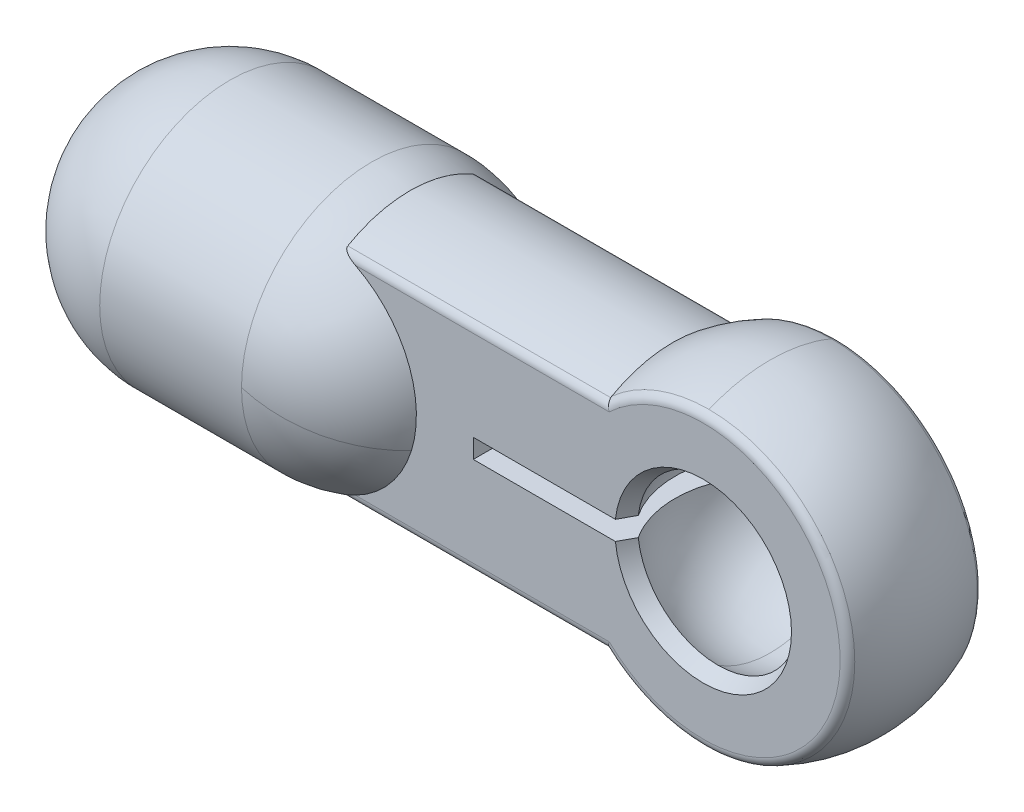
ISO-10303-21;
HEADER;
FILE_DESCRIPTION(('STEP AP214'),'2;1');
FILE_NAME('part.step','',(''),(''),'','','');
FILE_SCHEMA(('AUTOMOTIVE_DESIGN { 1 0 10303 214 1 1 1 1 }'));
ENDSEC;
DATA;
#1=APPLICATION_CONTEXT('core data for automotive mechanical design processes');
#2=APPLICATION_PROTOCOL_DEFINITION('international standard','automotive_design',2000,#1);
#3=PRODUCT_CONTEXT('',#1,'mechanical');
#4=PRODUCT('Part','Part','',(#3));
#5=PRODUCT_RELATED_PRODUCT_CATEGORY('part','',(#4));
#6=PRODUCT_DEFINITION_FORMATION('','',#4);
#7=PRODUCT_DEFINITION_CONTEXT('part definition',#1,'design');
#8=PRODUCT_DEFINITION('design','',#6,#7);
#9=PRODUCT_DEFINITION_SHAPE('','',#8);
#10=(LENGTH_UNIT() NAMED_UNIT(*) SI_UNIT(.MILLI.,.METRE.));
#11=(NAMED_UNIT(*) PLANE_ANGLE_UNIT() SI_UNIT($,.RADIAN.));
#12=(NAMED_UNIT(*) SI_UNIT($,.STERADIAN.) SOLID_ANGLE_UNIT());
#13=UNCERTAINTY_MEASURE_WITH_UNIT(LENGTH_MEASURE(1.E-05),#10,'distance_accuracy_value','');
#14=(GEOMETRIC_REPRESENTATION_CONTEXT(3) GLOBAL_UNCERTAINTY_ASSIGNED_CONTEXT((#13)) GLOBAL_UNIT_ASSIGNED_CONTEXT((#10,
#11,#12)) REPRESENTATION_CONTEXT('',''));
#15=CARTESIAN_POINT('',(0.,0.,0.));
#16=DIRECTION('',(0.,0.,1.));
#17=DIRECTION('',(1.,0.,0.));
#18=AXIS2_PLACEMENT_3D('',#15,#16,#17);
#19=CARTESIAN_POINT('',(0.,0.,0.));
#20=DIRECTION('',(0.,0.,1.));
#21=DIRECTION('',(-1.,0.,0.));
#22=AXIS2_PLACEMENT_3D('',#19,#20,#21);
#23=SPHERICAL_SURFACE('',#22,8.25);
#24=CARTESIAN_POINT('',(0.,0.,-3.19354838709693));
#25=DIRECTION('',(0.,0.,-1.));
#26=DIRECTION('',(0.998982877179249,0.0450911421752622,0.));
#27=AXIS2_PLACEMENT_3D('',#24,#25,#26);
#28=CIRCLE('',#27,7.60682251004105);
#29=CARTESIAN_POINT('',(4.29668195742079E-06,7.60682251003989,-3.19354838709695));
#30=VERTEX_POINT('',#29);
#31=CARTESIAN_POINT('',(7.5990878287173,0.342947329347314,-3.19354838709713));
#32=VERTEX_POINT('',#31);
#33=EDGE_CURVE('E375',#30,#32,#28,.T.);
#34=ORIENTED_EDGE('',*,*,#33,.F.);
#35=CARTESIAN_POINT('',(0.,8.24999999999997,0.));
#36=CARTESIAN_POINT('',(1.94166777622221E-07,8.25000300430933,-0.136634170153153));
#37=CARTESIAN_POINT('',(3.88331721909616E-07,8.24660576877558,-0.27326808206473));
#38=CARTESIAN_POINT('',(7.75225130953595E-07,8.23303239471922,-0.546198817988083));
#39=CARTESIAN_POINT('',(9.67953595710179E-07,8.2228562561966,-0.682495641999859));
#40=CARTESIAN_POINT('',(1.35054123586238E-06,8.19574665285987,-0.954415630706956));
#41=CARTESIAN_POINT('',(1.54040041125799E-06,8.17881318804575,-1.09003879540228));
#42=CARTESIAN_POINT('',(1.91583010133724E-06,8.1382316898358,-1.3602767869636));
#43=CARTESIAN_POINT('',(2.10140061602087E-06,8.11458365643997,-1.49489161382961));
#44=CARTESIAN_POINT('',(2.4668506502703E-06,8.06063106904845,-1.7627806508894));
#45=CARTESIAN_POINT('',(2.64673016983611E-06,8.03032651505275,-1.89605486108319));
#46=CARTESIAN_POINT('',(2.99942018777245E-06,7.96313598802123,-2.16093382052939));
#47=CARTESIAN_POINT('',(3.17223068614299E-06,7.9262500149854,-2.2925385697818));
#48=CARTESIAN_POINT('',(3.50943091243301E-06,7.84598677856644,-2.55375346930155));
#49=CARTESIAN_POINT('',(3.6738206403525E-06,7.80260951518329,-2.6833636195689));
#50=CARTESIAN_POINT('',(3.99287310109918E-06,7.70947408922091,-2.94027063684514));
#51=CARTESIAN_POINT('',(4.14753583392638E-06,7.65971592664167,-3.06756750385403));
#52=CARTESIAN_POINT('',(4.29668195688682E-06,7.60682251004,-3.193548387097));
#53=B_SPLINE_CURVE_WITH_KNOTS('',3,(#35,#36,#37,#38,#39,#40,#41,#42,#43,#44,#45,#46,#47,#48,#49,
#50,#51,#52),.UNSPECIFIED.,.F.,.F.,(4,2,2,2,2,2,2,2,4),(0.,0.409859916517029,0.819719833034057,
1.22957974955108,1.6394396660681,2.04929958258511,2.45915949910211,2.86901941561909,
3.27887933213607),.UNSPECIFIED.);
#54=CARTESIAN_POINT('',(0.,8.24999999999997,0.));
#55=VERTEX_POINT('',#54);
#56=EDGE_CURVE('E372',#55,#30,#53,.T.);
#57=ORIENTED_EDGE('',*,*,#56,.F.);
#58=CARTESIAN_POINT('',(0.,0.,0.));
#59=DIRECTION('',(1.,0.,0.));
#60=DIRECTION('',(0.,0.,-1.));
#61=AXIS2_PLACEMENT_3D('',#58,#59,#60);
#62=CIRCLE('',#61,8.25);
#63=CARTESIAN_POINT('',(0.,7.60682251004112,3.19354838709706));
#64=VERTEX_POINT('',#63);
#65=EDGE_CURVE('E371',#64,#55,#62,.F.);
#66=ORIENTED_EDGE('',*,*,#65,.F.);
#67=CARTESIAN_POINT('',(0.,0.,3.19354838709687));
#68=DIRECTION('',(0.,0.,1.));
#69=DIRECTION('',(-0.696747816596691,0.717316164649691,0.));
#70=AXIS2_PLACEMENT_3D('',#67,#68,#69);
#71=CIRCLE('',#70,7.60682251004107);
#72=CARTESIAN_POINT('',(0.,-7.60682251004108,3.19354838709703));
#73=VERTEX_POINT('',#72);
#74=EDGE_CURVE('E556',#73,#64,#71,.T.);
#75=ORIENTED_EDGE('',*,*,#74,.F.);
#76=CARTESIAN_POINT('',(0.,0.,0.));
#77=DIRECTION('',(-1.,0.,0.));
#78=DIRECTION('',(0.,0.,-1.));
#79=AXIS2_PLACEMENT_3D('',#76,#77,#78);
#80=CIRCLE('',#79,8.25);
#81=CARTESIAN_POINT('',(0.,-8.25,0.));
#82=VERTEX_POINT('',#81);
#83=EDGE_CURVE('E716',#82,#73,#80,.T.);
#84=ORIENTED_EDGE('',*,*,#83,.F.);
#85=CARTESIAN_POINT('',(4.29666835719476E-06,-7.60679843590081,-3.19360572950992));
#86=CARTESIAN_POINT('',(4.14752389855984E-06,-7.65969380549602,-3.06762285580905));
#87=CARTESIAN_POINT('',(3.9928626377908E-06,-7.70945381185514,-2.94032392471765));
#88=CARTESIAN_POINT('',(3.6738127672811E-06,-7.80259269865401,-2.68341264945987));
#89=CARTESIAN_POINT('',(3.50942415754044E-06,-7.84597157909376,-2.55380030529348));
#90=CARTESIAN_POINT('',(3.1722258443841E-06,-7.9262378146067,-2.29258090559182));
#91=CARTESIAN_POINT('',(2.99941614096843E-06,-7.96312516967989,-2.16097385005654));
#92=CARTESIAN_POINT('',(2.64672746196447E-06,-8.03031821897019,-1.8960901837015));
#93=CARTESIAN_POINT('',(2.46684848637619E-06,-8.0606239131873,-1.76281357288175));
#94=CARTESIAN_POINT('',(2.10139931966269E-06,-8.11457853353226,-1.49491965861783));
#95=CARTESIAN_POINT('',(1.91582912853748E-06,-8.13822745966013,-1.36030235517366));
#96=CARTESIAN_POINT('',(1.54039992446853E-06,-8.17881049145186,-1.0900593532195));
#97=CARTESIAN_POINT('',(1.35054091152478E-06,-8.19574459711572,-0.954433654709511));
#98=CARTESIAN_POINT('',(9.67953488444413E-07,-8.22285522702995,-0.682508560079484));
#99=CARTESIAN_POINT('',(7.75225078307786E-07,-8.23303175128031,-0.546209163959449));
#100=CARTESIAN_POINT('',(3.88331724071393E-07,-8.24660564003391,-0.273273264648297));
#101=CARTESIAN_POINT('',(1.94166779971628E-07,-8.25000300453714,-0.136636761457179));
#102=CARTESIAN_POINT('',(0.,-8.25,0.));
#103=B_SPLINE_CURVE_WITH_KNOTS('',3,(#85,#86,#87,#88,#89,#90,#91,#92,#93,#94,#95,#96,#97,#98,
#99,#100,#101,#102),.UNSPECIFIED.,.F.,.F.,(4,2,2,2,2,2,2,2,4),(0.,0.40986768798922,
0.819735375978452,1.2296030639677,1.63947075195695,2.04933843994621,2.45920612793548,
2.86907381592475,3.27894150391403),.UNSPECIFIED.);
#104=CARTESIAN_POINT('',(4.29666835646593E-06,-7.60679843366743,-3.19360572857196));
#105=VERTEX_POINT('',#104);
#106=EDGE_CURVE('E708',#105,#82,#103,.T.);
#107=ORIENTED_EDGE('',*,*,#106,.F.);
#108=CARTESIAN_POINT('',(7.5990878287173,0.342947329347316,-3.19354838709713));
#109=CARTESIAN_POINT('',(7.60486311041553,0.215037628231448,-3.19354898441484));
#110=CARTESIAN_POINT('',(7.60740306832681,0.0869821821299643,-3.19354958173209));
#111=CARTESIAN_POINT('',(7.60601885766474,-0.169093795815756,-3.19355077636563));
#112=CARTESIAN_POINT('',(7.6020946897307,-0.297114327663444,-3.19355137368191));
#113=CARTESIAN_POINT('',(7.58778875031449,-0.552794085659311,-3.19355256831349));
#114=CARTESIAN_POINT('',(7.57740697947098,-0.680453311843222,-3.1935531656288));
#115=CARTESIAN_POINT('',(7.55021323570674,-0.935085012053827,-3.19355436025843));
#116=CARTESIAN_POINT('',(7.53340126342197,-1.06205748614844,-3.19355495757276));
#117=CARTESIAN_POINT('',(7.49338972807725,-1.31499198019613,-3.19355615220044));
#118=CARTESIAN_POINT('',(7.47019016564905,-1.44095400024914,-3.1935567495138));
#119=CARTESIAN_POINT('',(7.41746266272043,-1.69154646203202,-3.19355794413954));
#120=CARTESIAN_POINT('',(7.38793472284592,-1.81617690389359,-3.19355854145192));
#121=CARTESIAN_POINT('',(7.3226257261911,-2.06378847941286,-3.1935597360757));
#122=CARTESIAN_POINT('',(7.28684467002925,-2.1867696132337,-3.19356033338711));
#123=CARTESIAN_POINT('',(7.20912066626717,-2.43076904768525,-3.19356152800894));
#124=CARTESIAN_POINT('',(7.16717771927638,-2.55178734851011,-3.19356212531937));
#125=CARTESIAN_POINT('',(7.07723686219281,-2.79155259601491,-3.19356331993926));
#126=CARTESIAN_POINT('',(7.02923895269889,-2.9102995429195,-3.19356391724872));
#127=CARTESIAN_POINT('',(6.92731053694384,-3.14521935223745,-3.19356511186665));
#128=CARTESIAN_POINT('',(6.87338003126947,-3.26139221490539,-3.19356570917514));
#129=CARTESIAN_POINT('',(6.75972391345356,-3.49086768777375,-3.19356690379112));
#130=CARTESIAN_POINT('',(6.6999983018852,-3.60417029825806,-3.19356750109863));
#131=CARTESIAN_POINT('',(6.5749042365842,-3.82761641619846,-3.19356869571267));
#132=CARTESIAN_POINT('',(6.5095357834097,-3.93775992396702,-3.1935692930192));
#133=CARTESIAN_POINT('',(6.37332268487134,-4.15460703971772,-3.19357048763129));
#134=CARTESIAN_POINT('',(6.30247804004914,-4.26131064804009,-3.19357108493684));
#135=CARTESIAN_POINT('',(6.1554931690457,-4.47100593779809,-3.19357227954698));
#136=CARTESIAN_POINT('',(6.07935294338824,-4.57399761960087,-3.19357287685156));
#137=CARTESIAN_POINT('',(5.92197102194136,-4.77600649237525,-3.19357407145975));
#138=CARTESIAN_POINT('',(5.84072932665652,-4.87502368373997,-3.19357466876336));
#139=CARTESIAN_POINT('',(5.67335158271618,-5.06883114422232,-3.1935758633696));
#140=CARTESIAN_POINT('',(5.58721553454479,-5.16362141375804,-3.19357646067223));
#141=CARTESIAN_POINT('',(5.41026867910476,-5.34873337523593,-3.19357765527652));
#142=CARTESIAN_POINT('',(5.31945787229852,-5.43905506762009,-3.19357825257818));
#143=CARTESIAN_POINT('',(5.13339301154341,-5.61499961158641,-3.19357944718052));
#144=CARTESIAN_POINT('',(5.03813895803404,-5.70062246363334,-3.1935800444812));
#145=CARTESIAN_POINT('',(4.84343044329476,-5.86695104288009,-3.19358123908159));
#146=CARTESIAN_POINT('',(4.74397598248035,-5.94765677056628,-3.1935818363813));
#147=CARTESIAN_POINT('',(4.54112020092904,-6.10394535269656,-3.19358303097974));
#148=CARTESIAN_POINT('',(4.43771888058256,-6.17952820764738,-3.19358362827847));
#149=CARTESIAN_POINT('',(4.22723298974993,-6.32537835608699,-3.19358482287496));
#150=CARTESIAN_POINT('',(4.12014841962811,-6.39564565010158,-3.19358542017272));
#151=CARTESIAN_POINT('',(3.90256902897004,-6.53068553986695,-3.19358661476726));
#152=CARTESIAN_POINT('',(3.79207420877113,-6.59545813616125,-3.19358721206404));
#153=CARTESIAN_POINT('',(3.56795601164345,-6.71934350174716,-3.19358840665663));
#154=CARTESIAN_POINT('',(3.45433263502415,-6.77845627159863,-3.19358900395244));
#155=CARTESIAN_POINT('',(3.22424699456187,-6.8908712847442,-3.19359019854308));
#156=CARTESIAN_POINT('',(3.10778473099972,-6.94417352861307,-3.19359079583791));
#157=CARTESIAN_POINT('',(2.87231822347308,-7.04483160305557,-3.1935919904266));
#158=CARTESIAN_POINT('',(2.75331397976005,-7.09218743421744,-3.19359258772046));
#159=CARTESIAN_POINT('',(2.51306689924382,-7.18083195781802,-3.1935937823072));
#160=CARTESIAN_POINT('',(2.39182406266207,-7.22212065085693,-3.19359437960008));
#161=CARTESIAN_POINT('',(2.14740889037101,-7.29852563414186,-3.19359557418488));
#162=CARTESIAN_POINT('',(2.02423655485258,-7.33364192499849,-3.19359617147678));
#163=CARTESIAN_POINT('',(1.77627639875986,-7.3976125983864,-3.19359736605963));
#164=CARTESIAN_POINT('',(1.65148857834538,-7.42646698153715,-3.19359796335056));
#165=CARTESIAN_POINT('',(1.40061558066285,-7.47784021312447,-3.19359915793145));
#166=CARTESIAN_POINT('',(1.27453040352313,-7.5003590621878,-3.19359975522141));
#167=CARTESIAN_POINT('',(1.02138414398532,-7.53900406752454,-3.19360094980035));
#168=CARTESIAN_POINT('',(0.894323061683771,-7.55513022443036,-3.19360154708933));
#169=CARTESIAN_POINT('',(0.639548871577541,-7.58094780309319,-3.19360274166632));
#170=CARTESIAN_POINT('',(0.511835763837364,-7.59063922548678,-3.19360333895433));
#171=CARTESIAN_POINT('',(0.256083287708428,-7.60356610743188,-3.19360453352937));
#172=CARTESIAN_POINT('',(0.128043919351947,-7.60680156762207,-3.1936051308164));
#173=CARTESIAN_POINT('',(4.29666835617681E-06,-7.60679843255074,-3.19360572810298));
#174=B_SPLINE_CURVE_WITH_KNOTS('',3,(#108,#109,#110,#111,#112,#113,#114,#115,#116,#117,#118,
#119,#120,#121,#122,#123,#124,#125,#126,#127,#128,#129,#130,#131,#132,#133,#134,#135,#136,#137,
#138,#139,#140,#141,#142,#143,#144,#145,#146,#147,#148,#149,#150,#151,#152,#153,#154,#155,#156,
#157,#158,#159,#160,#161,#162,#163,#164,#165,#166,#167,#168,#169,#170,#171,#172,#173),
.UNSPECIFIED.,.F.,.F.,(4,2,2,2,2,2,2,2,2,2,2,2,2,2,2,2,2,2,2,2,2,2,2,2,2,2,2,2,2,2,2,2,4),(0.,
0.384078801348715,0.768157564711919,1.15223629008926,1.53631497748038,1.92039362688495,
2.30447223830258,2.68855081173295,3.0726293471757,3.45670784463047,3.84078630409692,
4.22486472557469,4.60894310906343,4.9930214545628,5.37709976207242,5.76117803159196,
6.14525626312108,6.5293344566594,6.91341261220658,7.29749072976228,7.68156880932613,
8.06564685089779,8.4497248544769,8.83380282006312,9.21788074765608,9.60195863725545,
9.98603648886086,10.370114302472,10.7541920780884,11.1382698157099,11.522347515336,
11.9064251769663,12.2905028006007),.UNSPECIFIED.);
#175=EDGE_CURVE('E421',#32,#105,#174,.T.);
#176=ORIENTED_EDGE('',*,*,#175,.F.);
#177=EDGE_LOOP('',(#34,#57,#66,#75,#84,#107,#176));
#178=FACE_BOUND('',#177,.T.);
#179=ADVANCED_FACE('F16',(#178),#23,.T.);
#180=CARTESIAN_POINT('',(-12.,0.5,-9.9));
#181=DIRECTION('',(-1.,0.,0.));
#182=DIRECTION('',(0.,0.,1.));
#183=AXIS2_PLACEMENT_3D('',#180,#181,#182);
#184=PLANE('',#183);
#185=DIRECTION('',(0.,1.,0.));
#186=VECTOR('',#185,1.);
#187=CARTESIAN_POINT('',(-12.,0.5,-3.5));
#188=LINE('',#187,#186);
#189=CARTESIAN_POINT('',(-12.,0.499999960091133,-3.5));
#190=VERTEX_POINT('',#189);
#191=CARTESIAN_POINT('',(-12.,-0.499999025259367,-3.5));
#192=VERTEX_POINT('',#191);
#193=EDGE_CURVE('E665',#190,#192,#188,.F.);
#194=ORIENTED_EDGE('',*,*,#193,.F.);
#195=DIRECTION('',(0.,0.,1.));
#196=VECTOR('',#195,1.);
#197=CARTESIAN_POINT('',(-12.,0.5,-9.9));
#198=LINE('',#197,#196);
#199=CARTESIAN_POINT('',(-12.,0.5000000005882,3.5));
#200=VERTEX_POINT('',#199);
#201=EDGE_CURVE('E576',#190,#200,#198,.T.);
#202=ORIENTED_EDGE('',*,*,#201,.T.);
#203=DIRECTION('',(0.,1.,0.));
#204=VECTOR('',#203,1.);
#205=CARTESIAN_POINT('',(-12.,0.5,3.5));
#206=LINE('',#205,#204);
#207=CARTESIAN_POINT('',(-12.,-0.499999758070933,3.5));
#208=VERTEX_POINT('',#207);
#209=EDGE_CURVE('E663',#208,#200,#206,.T.);
#210=ORIENTED_EDGE('',*,*,#209,.F.);
#211=DIRECTION('',(0.,0.,-1.));
#212=VECTOR('',#211,1.);
#213=CARTESIAN_POINT('',(-12.,-0.5,-9.9));
#214=LINE('',#213,#212);
#215=EDGE_CURVE('E582',#208,#192,#214,.T.);
#216=ORIENTED_EDGE('',*,*,#215,.T.);
#217=EDGE_LOOP('',(#194,#202,#210,#216));
#218=FACE_BOUND('',#217,.T.);
#219=ADVANCED_FACE('F667',(#218),#184,.F.);
#220=CARTESIAN_POINT('',(0.,0.,0.));
#221=DIRECTION('',(0.,0.,-1.));
#222=DIRECTION('',(1.,0.,0.));
#223=AXIS2_PLACEMENT_3D('',#220,#221,#222);
#224=SPHERICAL_SURFACE('',#223,5.);
#225=CARTESIAN_POINT('',(0.,0.,2.72732233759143));
#226=DIRECTION('',(0.,0.,1.));
#227=DIRECTION('',(1.,0.,0.));
#228=AXIS2_PLACEMENT_3D('',#225,#226,#227);
#229=CIRCLE('',#228,4.19066973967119);
#230=CARTESIAN_POINT('',(0.,4.19066973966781,2.72732233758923));
#231=VERTEX_POINT('',#230);
#232=CARTESIAN_POINT('',(-4.16073465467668,0.5,2.72732233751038));
#233=VERTEX_POINT('',#232);
#234=EDGE_CURVE('E599',#231,#233,#229,.T.);
#235=ORIENTED_EDGE('',*,*,#234,.T.);
#236=CARTESIAN_POINT('',(-4.16073465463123,0.5,2.72732233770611));
#237=CARTESIAN_POINT('',(-4.23745821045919,0.5,2.61030225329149));
#238=CARTESIAN_POINT('',(-4.30921848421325,0.5,2.49003136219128));
#239=CARTESIAN_POINT('',(-4.44235695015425,0.5,2.24388112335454));
#240=CARTESIAN_POINT('',(-4.50373562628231,0.5,2.11800203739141));
#241=CARTESIAN_POINT('',(-4.61561714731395,0.5,1.86162168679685));
#242=CARTESIAN_POINT('',(-4.66612878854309,0.5,1.73112426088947));
#243=CARTESIAN_POINT('',(-4.75598410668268,0.5,1.46634170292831));
#244=CARTESIAN_POINT('',(-4.79532794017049,0.5,1.33205662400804));
#245=CARTESIAN_POINT('',(-4.86257553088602,0.5,1.06061981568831));
#246=CARTESIAN_POINT('',(-4.89047671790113,0.5,0.923467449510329));
#247=CARTESIAN_POINT('',(-4.93463602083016,0.5,0.64725202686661));
#248=CARTESIAN_POINT('',(-4.95089008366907,0.5,0.50818832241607));
#249=CARTESIAN_POINT('',(-4.97162249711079,0.5,0.229201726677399));
#250=CARTESIAN_POINT('',(-4.97610218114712,0.5,0.0892789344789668));
#251=CARTESIAN_POINT('',(-4.97325785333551,0.5,-0.190446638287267));
#252=CARTESIAN_POINT('',(-4.96593384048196,0.5,-0.330249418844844));
#253=CARTESIAN_POINT('',(-4.93952585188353,0.5,-0.608829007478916));
#254=CARTESIAN_POINT('',(-4.92043444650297,0.5,-0.747605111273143));
#255=CARTESIAN_POINT('',(-4.87062965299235,0.5,-1.02300602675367));
#256=CARTESIAN_POINT('',(-4.8399203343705,0.5,-1.15963157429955));
#257=CARTESIAN_POINT('',(-4.76712003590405,0.5,-1.42972651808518));
#258=CARTESIAN_POINT('',(-4.72503591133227,0.5,-1.56319776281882));
#259=CARTESIAN_POINT('',(-4.62979378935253,0.5,-1.82607373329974));
#260=CARTESIAN_POINT('',(-4.57664018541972,0.5,-1.95548004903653));
#261=CARTESIAN_POINT('',(-4.4665994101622,0.5,-2.1942302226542));
#262=CARTESIAN_POINT('',(-4.41091034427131,0.5,-2.30412826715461));
#263=CARTESIAN_POINT('',(-4.29165706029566,0.5,-2.5192855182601));
#264=CARTESIAN_POINT('',(-4.22810836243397,0.5,-2.62455332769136));
#265=CARTESIAN_POINT('',(-4.16073468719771,0.5,-2.7273222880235));
#266=B_SPLINE_CURVE_WITH_KNOTS('',3,(#236,#237,#238,#239,#240,#241,#242,#243,#244,#245,#246,
#247,#248,#249,#250,#251,#252,#253,#254,#255,#256,#257,#258,#259,#260,#261,#262,#263,#264,#265),
.UNSPECIFIED.,.F.,.F.,(4,2,2,2,2,2,2,2,2,2,2,2,2,2,4),(0.,0.419659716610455,0.839299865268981,
1.25859904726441,1.67789235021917,2.09727978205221,2.51681308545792,2.93629887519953,
3.35578470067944,3.77553565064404,4.19513970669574,4.61449144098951,5.03367705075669,
5.40295136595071,5.77150779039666),.UNSPECIFIED.);
#267=CARTESIAN_POINT('',(-4.16073465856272,0.5,-2.72732229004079));
#268=VERTEX_POINT('',#267);
#269=EDGE_CURVE('E579',#233,#268,#266,.T.);
#270=ORIENTED_EDGE('',*,*,#269,.T.);
#271=CARTESIAN_POINT('',(0.,0.,-2.72732229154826));
#272=DIRECTION('',(0.,0.,-1.));
#273=DIRECTION('',(-1.,0.,0.));
#274=AXIS2_PLACEMENT_3D('',#271,#272,#273);
#275=CIRCLE('',#274,4.19066971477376);
#276=CARTESIAN_POINT('',(0.,4.1906697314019,-2.72732232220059));
#277=VERTEX_POINT('',#276);
#278=EDGE_CURVE('E675',#268,#277,#275,.T.);
#279=ORIENTED_EDGE('',*,*,#278,.T.);
#280=CARTESIAN_POINT('',(0.,0.,0.));
#281=DIRECTION('',(-1.,0.,0.));
#282=DIRECTION('',(0.,0.,1.));
#283=AXIS2_PLACEMENT_3D('',#280,#281,#282);
#284=CIRCLE('',#283,5.);
#285=EDGE_CURVE('E689',#277,#231,#284,.F.);
#286=ORIENTED_EDGE('',*,*,#285,.T.);
#287=EDGE_LOOP('',(#235,#270,#279,#286));
#288=FACE_BOUND('',#287,.T.);
#289=ADVANCED_FACE('F898',(#288),#224,.F.);
#290=CARTESIAN_POINT('',(0.,0.,0.));
#291=DIRECTION('',(0.,0.,1.));
#292=DIRECTION('',(-1.,0.,0.));
#293=AXIS2_PLACEMENT_3D('',#290,#291,#292);
#294=SPHERICAL_SURFACE('',#293,5.);
#295=ORIENTED_EDGE('',*,*,#285,.F.);
#296=CARTESIAN_POINT('',(0.,0.,-2.72732233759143));
#297=DIRECTION('',(0.,0.,-1.));
#298=DIRECTION('',(-1.,0.,0.));
#299=AXIS2_PLACEMENT_3D('',#296,#297,#298);
#300=CIRCLE('',#299,4.19066973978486);
#301=CARTESIAN_POINT('',(0.,-4.19066973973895,-2.72732233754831));
#302=VERTEX_POINT('',#301);
#303=EDGE_CURVE('E676',#277,#302,#300,.T.);
#304=ORIENTED_EDGE('',*,*,#303,.T.);
#305=CARTESIAN_POINT('',(0.,0.,0.));
#306=DIRECTION('',(-1.,0.,0.));
#307=DIRECTION('',(0.,0.,-1.));
#308=AXIS2_PLACEMENT_3D('',#305,#306,#307);
#309=CIRCLE('',#308,5.);
#310=CARTESIAN_POINT('',(0.,-4.19066973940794,2.72732233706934));
#311=VERTEX_POINT('',#310);
#312=EDGE_CURVE('E717',#302,#311,#309,.T.);
#313=ORIENTED_EDGE('',*,*,#312,.T.);
#314=CARTESIAN_POINT('',(0.,0.,2.72732233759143));
#315=DIRECTION('',(0.,0.,1.));
#316=DIRECTION('',(1.,0.,0.));
#317=AXIS2_PLACEMENT_3D('',#314,#315,#316);
#318=CIRCLE('',#317,4.19066973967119);
#319=CARTESIAN_POINT('',(4.19066973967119,0.,2.72732233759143));
#320=VERTEX_POINT('',#319);
#321=EDGE_CURVE('E695',#311,#320,#318,.T.);
#322=ORIENTED_EDGE('',*,*,#321,.T.);
#323=CARTESIAN_POINT('',(0.,0.,2.72732233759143));
#324=DIRECTION('',(0.,0.,1.));
#325=DIRECTION('',(1.,0.,0.));
#326=AXIS2_PLACEMENT_3D('',#323,#324,#325);
#327=CIRCLE('',#326,4.19066973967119);
#328=EDGE_CURVE('E340',#320,#231,#327,.T.);
#329=ORIENTED_EDGE('',*,*,#328,.T.);
#330=EDGE_LOOP('',(#295,#304,#313,#322,#329));
#331=FACE_BOUND('',#330,.T.);
#332=ADVANCED_FACE('F891',(#331),#294,.F.);
#333=CARTESIAN_POINT('',(0.,0.,0.));
#334=DIRECTION('',(0.,0.,-1.));
#335=DIRECTION('',(1.,0.,0.));
#336=AXIS2_PLACEMENT_3D('',#333,#334,#335);
#337=SPHERICAL_SURFACE('',#336,5.);
#338=ORIENTED_EDGE('',*,*,#312,.F.);
#339=CARTESIAN_POINT('',(0.,0.,-2.72732233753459));
#340=DIRECTION('',(0.,0.,-1.));
#341=DIRECTION('',(-1.,0.,0.));
#342=AXIS2_PLACEMENT_3D('',#339,#340,#341);
#343=CIRCLE('',#342,4.19066973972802);
#344=CARTESIAN_POINT('',(-4.16073467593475,-0.500000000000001,-2.72732230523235));
#345=VERTEX_POINT('',#344);
#346=EDGE_CURVE('E457',#302,#345,#343,.T.);
#347=ORIENTED_EDGE('',*,*,#346,.T.);
#348=CARTESIAN_POINT('',(-4.16073469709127,-0.499999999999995,-2.72732227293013));
#349=CARTESIAN_POINT('',(-4.23745825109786,-0.499999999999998,-2.61030218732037));
#350=CARTESIAN_POINT('',(-4.30921852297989,-0.5,-2.49003129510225));
#351=CARTESIAN_POINT('',(-4.44235698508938,-0.5,-2.24388105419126));
#352=CARTESIAN_POINT('',(-4.50373565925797,-0.5,-2.11800196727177));
#353=CARTESIAN_POINT('',(-4.61561717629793,-0.5,-1.86162161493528));
#354=CARTESIAN_POINT('',(-4.66612881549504,-0.5,-1.73112418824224));
#355=CARTESIAN_POINT('',(-4.75598412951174,-0.5,-1.46634162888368));
#356=CARTESIAN_POINT('',(-4.79532796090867,-0.5,-1.33205654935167));
#357=CARTESIAN_POINT('',(-4.86257554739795,-0.5,-1.06061973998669));
#358=CARTESIAN_POINT('',(-4.89047673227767,-0.5,-0.923467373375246));
#359=CARTESIAN_POINT('',(-4.93463603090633,-0.5,-0.647251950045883));
#360=CARTESIAN_POINT('',(-4.95089009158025,-0.5,-0.508188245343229));
#361=CARTESIAN_POINT('',(-4.97162250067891,-0.5,-0.229201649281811));
#362=CARTESIAN_POINT('',(-4.97610218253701,-0.5,-0.0892788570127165));
#363=CARTESIAN_POINT('',(-4.97325785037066,-0.5,0.190446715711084));
#364=CARTESIAN_POINT('',(-4.96593383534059,-0.5,0.330249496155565));
#365=CARTESIAN_POINT('',(-4.93952584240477,-0.5,0.608829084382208));
#366=CARTESIAN_POINT('',(-4.9204344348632,-0.5,0.747605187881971));
#367=CARTESIAN_POINT('',(-4.87062963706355,-0.5,1.02300610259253));
#368=CARTESIAN_POINT('',(-4.83992031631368,-0.5,1.15963164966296));
#369=CARTESIAN_POINT('',(-4.76712001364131,-0.5,1.42972659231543));
#370=CARTESIAN_POINT('',(-4.72503588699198,-0.5,1.56319783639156));
#371=CARTESIAN_POINT('',(-4.62979376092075,-0.5,1.82607380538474));
#372=CARTESIAN_POINT('',(-4.57664015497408,-0.5,1.95548012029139));
#373=CARTESIAN_POINT('',(-4.46659937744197,-0.5,2.19423028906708));
#374=CARTESIAN_POINT('',(-4.41091031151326,-0.5,2.3041283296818));
#375=CARTESIAN_POINT('',(-4.29165702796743,-0.5,2.5192855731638));
#376=CARTESIAN_POINT('',(-4.22810833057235,-0.5,2.62455337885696));
#377=CARTESIAN_POINT('',(-4.16073465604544,-0.5,2.72732233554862));
#378=B_SPLINE_CURVE_WITH_KNOTS('',3,(#348,#349,#350,#351,#352,#353,#354,#355,#356,#357,#358,
#359,#360,#361,#362,#363,#364,#365,#366,#367,#368,#369,#370,#371,#372,#373,#374,#375,#376,#377),
.UNSPECIFIED.,.F.,.F.,(4,2,2,2,2,2,2,2,2,2,2,2,2,2,4),(0.,0.419659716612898,0.839299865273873,
1.25859904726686,1.67789235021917,2.09727978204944,2.51681308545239,2.93629887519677,
3.35578470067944,3.77553565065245,4.19513970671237,4.61449144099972,5.03367705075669,
5.40295135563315,5.77150776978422),.UNSPECIFIED.);
#379=CARTESIAN_POINT('',(-4.16073465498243,-0.5,2.72732233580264));
#380=VERTEX_POINT('',#379);
#381=EDGE_CURVE('E422',#345,#380,#378,.T.);
#382=ORIENTED_EDGE('',*,*,#381,.T.);
#383=CARTESIAN_POINT('',(0.,0.,2.72732233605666));
#384=DIRECTION('',(0.,0.,1.));
#385=DIRECTION('',(1.,0.,0.));
#386=AXIS2_PLACEMENT_3D('',#383,#384,#385);
#387=CIRCLE('',#386,4.19066973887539);
#388=EDGE_CURVE('E698',#380,#311,#387,.T.);
#389=ORIENTED_EDGE('',*,*,#388,.T.);
#390=EDGE_LOOP('',(#338,#347,#382,#389));
#391=FACE_BOUND('',#390,.T.);
#392=ADVANCED_FACE('F434',(#391),#337,.F.);
#393=CARTESIAN_POINT('',(0.,0.,0.));
#394=DIRECTION('',(0.,0.,-1.));
#395=DIRECTION('',(1.,0.,0.));
#396=AXIS2_PLACEMENT_3D('',#393,#394,#395);
#397=SPHERICAL_SURFACE('',#396,8.25);
#398=ORIENTED_EDGE('',*,*,#106,.T.);
#399=ORIENTED_EDGE('',*,*,#83,.T.);
#400=CARTESIAN_POINT('',(0.,0.,3.19354838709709));
#401=DIRECTION('',(0.,0.,1.));
#402=DIRECTION('',(0.998982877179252,-0.0450911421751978,0.));
#403=AXIS2_PLACEMENT_3D('',#400,#401,#402);
#404=CIRCLE('',#403,7.60682251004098);
#405=CARTESIAN_POINT('',(-5.08060035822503,-5.66138222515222,3.1935483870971));
#406=VERTEX_POINT('',#405);
#407=EDGE_CURVE('E209',#406,#73,#404,.T.);
#408=ORIENTED_EDGE('',*,*,#407,.F.);
#409=CARTESIAN_POINT('',(-5.080600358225,0.,0.));
#410=DIRECTION('',(-1.,0.,0.));
#411=DIRECTION('',(0.,0.,1.));
#412=AXIS2_PLACEMENT_3D('',#409,#410,#411);
#413=CIRCLE('',#412,6.5);
#414=CARTESIAN_POINT('',(-5.08060035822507,-5.66138222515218,-3.1935483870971));
#415=VERTEX_POINT('',#414);
#416=EDGE_CURVE('E646',#415,#406,#413,.T.);
#417=ORIENTED_EDGE('',*,*,#416,.F.);
#418=CARTESIAN_POINT('',(4.29666835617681E-06,-7.60679843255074,-3.19360572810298));
#419=CARTESIAN_POINT('',(-0.115901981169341,-7.60680098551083,-3.19360453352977));
#420=CARTESIAN_POINT('',(-0.231808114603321,-7.60415051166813,-3.19360333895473));
#421=CARTESIAN_POINT('',(-0.463378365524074,-7.59355776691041,-3.19360094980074));
#422=CARTESIAN_POINT('',(-0.579042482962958,-7.58561549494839,-3.1935997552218));
#423=CARTESIAN_POINT('',(-0.809886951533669,-7.56445340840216,-3.19359736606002));
#424=CARTESIAN_POINT('',(-0.925067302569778,-7.55123359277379,-3.19359617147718));
#425=CARTESIAN_POINT('',(-1.1547036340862,-7.51954466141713,-3.19359378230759));
#426=CARTESIAN_POINT('',(-1.26915961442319,-7.50107554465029,-3.19359258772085));
#427=CARTESIAN_POINT('',(-1.4971080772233,-7.45892642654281,-3.19359019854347));
#428=CARTESIAN_POINT('',(-1.61060055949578,-7.43524642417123,-3.19358900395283));
#429=CARTESIAN_POINT('',(-1.83638492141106,-7.38272504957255,-3.19358661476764));
#430=CARTESIAN_POINT('',(-1.94867680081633,-7.35388367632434,-3.1935854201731));
#431=CARTESIAN_POINT('',(-2.17182535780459,-7.29109980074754,-3.19358303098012));
#432=CARTESIAN_POINT('',(-2.28268203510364,-7.25715729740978,-3.19358183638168));
#433=CARTESIAN_POINT('',(-2.50272858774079,-7.18424207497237,-3.1935794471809));
#434=CARTESIAN_POINT('',(-2.61191846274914,-7.14526935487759,-3.19357825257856));
#435=CARTESIAN_POINT('',(-2.82840329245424,-7.06237511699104,-3.19357586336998));
#436=CARTESIAN_POINT('',(-2.93569824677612,-7.01845359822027,-3.19357466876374));
#437=CARTESIAN_POINT('',(-3.14816907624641,-6.92575352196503,-3.19357227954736));
#438=CARTESIAN_POINT('',(-3.25334495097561,-6.87697496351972,-3.19357108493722));
#439=CARTESIAN_POINT('',(-3.46135788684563,-6.77466271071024,-3.19356869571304));
#440=CARTESIAN_POINT('',(-3.56419494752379,-6.7211290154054,-3.193567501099));
#441=CARTESIAN_POINT('',(-3.76731541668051,-6.60941833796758,-3.19356511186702));
#442=CARTESIAN_POINT('',(-3.86759882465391,-6.55124135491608,-3.19356391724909));
#443=CARTESIAN_POINT('',(-4.06540244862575,-6.43036560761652,-3.19356152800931));
#444=CARTESIAN_POINT('',(-4.16292266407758,-6.367666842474,-3.19356033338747));
#445=CARTESIAN_POINT('',(-4.35499627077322,-6.23787864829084,-3.1935579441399));
#446=CARTESIAN_POINT('',(-4.44954966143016,-6.17078921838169,-3.19355674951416));
#447=CARTESIAN_POINT('',(-4.63549168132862,-6.03235936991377,-3.19355436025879));
#448=CARTESIAN_POINT('',(-4.72688030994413,-5.96101895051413,-3.19355316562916));
#449=CARTESIAN_POINT('',(-4.90630335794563,-5.81423797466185,-3.19355077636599));
#450=CARTESIAN_POINT('',(-4.99433777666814,-5.73879741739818,-3.19354958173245));
#451=CARTESIAN_POINT('',(-5.08060035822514,-5.66138222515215,-3.19354838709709));
#452=B_SPLINE_CURVE_WITH_KNOTS('',3,(#418,#419,#420,#421,#422,#423,#424,#425,#426,#427,#428,
#429,#430,#431,#432,#433,#434,#435,#436,#437,#438,#439,#440,#441,#442,#443,#444,#445,#446,#447,
#448,#449,#450,#451),.UNSPECIFIED.,.F.,.F.,(4,2,2,2,2,2,2,2,2,2,2,2,2,2,2,2,4),(0.,
0.347688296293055,0.695376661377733,1.04306509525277,1.39075359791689,1.73844216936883,
2.08613080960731,2.43381951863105,2.78150829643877,3.12919714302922,3.47688605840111,
3.82457504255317,4.17226409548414,4.51995321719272,4.86764240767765,5.21533166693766,
5.56302099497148),.UNSPECIFIED.);
#453=EDGE_CURVE('E480',#105,#415,#452,.T.);
#454=ORIENTED_EDGE('',*,*,#453,.F.);
#455=EDGE_LOOP('',(#398,#399,#408,#417,#454));
#456=FACE_BOUND('',#455,.T.);
#457=ADVANCED_FACE('F722',(#456),#397,.T.);
#458=CARTESIAN_POINT('',(51.5947,-5.196152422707,3.));
#459=DIRECTION('',(-1.,0.,0.));
#460=DIRECTION('',(0.,0.,1.));
#461=AXIS2_PLACEMENT_3D('',#458,#459,#460);
#462=CYLINDRICAL_SURFACE('',#461,0.5);
#463=CARTESIAN_POINT('',(-4.905354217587,-5.196152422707,3.5));
#464=CARTESIAN_POINT('',(-4.90947592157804,-5.20652104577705,3.50000027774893));
#465=CARTESIAN_POINT('',(-4.91359220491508,-5.21689173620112,3.49967744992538));
#466=CARTESIAN_POINT('',(-4.92148388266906,-5.2368171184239,3.49843616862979));
#467=CARTESIAN_POINT('',(-4.92526140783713,-5.24637392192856,3.49756484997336));
#468=CARTESIAN_POINT('',(-4.93246748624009,-5.26465141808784,3.49536746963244));
#469=CARTESIAN_POINT('',(-4.93589914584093,-5.27337611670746,3.49408479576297));
#470=CARTESIAN_POINT('',(-4.94241546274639,-5.28997911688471,3.49119493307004));
#471=CARTESIAN_POINT('',(-4.94550356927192,-5.29786296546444,3.48962730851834));
#472=CARTESIAN_POINT('',(-4.95134049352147,-5.31278258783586,3.4862859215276));
#473=CARTESIAN_POINT('',(-4.95409264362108,-5.31982507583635,3.48454791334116));
#474=CARTESIAN_POINT('',(-4.95927315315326,-5.33306516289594,3.48097162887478));
#475=CARTESIAN_POINT('',(-4.96170384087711,-5.33927051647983,3.47916539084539));
#476=CARTESIAN_POINT('',(-4.96648683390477,-5.35144703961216,3.4753597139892));
#477=CARTESIAN_POINT('',(-4.96883951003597,-5.35742005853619,3.47336665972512));
#478=CARTESIAN_POINT('',(-4.9735244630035,-5.36930995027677,3.46914595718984));
#479=CARTESIAN_POINT('',(-4.97585667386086,-5.37522664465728,3.46691773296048));
#480=CARTESIAN_POINT('',(-4.98049633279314,-5.38699576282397,3.46222659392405));
#481=CARTESIAN_POINT('',(-4.98280370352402,-5.39284798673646,3.45976310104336));
#482=CARTESIAN_POINT('',(-4.98738677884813,-5.40448099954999,3.45460201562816));
#483=CARTESIAN_POINT('',(-4.98966238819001,-5.41026156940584,3.45190384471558));
#484=CARTESIAN_POINT('',(-4.99417632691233,-5.42174342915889,3.44627419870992));
#485=CARTESIAN_POINT('',(-4.99641454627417,-5.4274444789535,3.44334214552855));
#486=CARTESIAN_POINT('',(-5.0008452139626,-5.43876067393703,3.43724651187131));
#487=CARTESIAN_POINT('',(-5.00303752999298,-5.44437556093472,3.43408235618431));
#488=CARTESIAN_POINT('',(-5.00773789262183,-5.45643130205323,3.42697874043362));
#489=CARTESIAN_POINT('',(-5.01023683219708,-5.4628517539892,3.42299852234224));
#490=CARTESIAN_POINT('',(-5.01513785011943,-5.47544177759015,3.41478988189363));
#491=CARTESIAN_POINT('',(-5.01754075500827,-5.48161349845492,3.41056524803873));
#492=CARTESIAN_POINT('',(-5.02224390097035,-5.49370136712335,3.40188494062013));
#493=CARTESIAN_POINT('',(-5.02454506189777,-5.49961977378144,3.3974329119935));
#494=CARTESIAN_POINT('',(-5.02904265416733,-5.51119544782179,3.38831443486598));
#495=CARTESIAN_POINT('',(-5.03124005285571,-5.51685509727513,3.38365148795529));
#496=CARTESIAN_POINT('',(-5.03552789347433,-5.52790890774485,3.37412782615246));
#497=CARTESIAN_POINT('',(-5.03761935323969,-5.53330556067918,3.36927046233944));
#498=CARTESIAN_POINT('',(-5.04169391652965,-5.54382967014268,3.3593744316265));
#499=CARTESIAN_POINT('',(-5.04367807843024,-5.54895972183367,3.3543389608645));
#500=CARTESIAN_POINT('',(-5.04753717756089,-5.55894768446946,3.34410298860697));
#501=CARTESIAN_POINT('',(-5.04941320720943,-5.56380828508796,3.33890552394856));
#502=CARTESIAN_POINT('',(-5.05305574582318,-5.57325510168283,3.32836158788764));
#503=CARTESIAN_POINT('',(-5.05482337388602,-5.57784409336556,3.32301799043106));
#504=CARTESIAN_POINT('',(-5.05824933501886,-5.5867461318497,3.31219752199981));
#505=CARTESIAN_POINT('',(-5.0599088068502,-5.5910620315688,3.30672335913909));
#506=CARTESIAN_POINT('',(-5.06311918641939,-5.59941698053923,3.29565717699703));
#507=CARTESIAN_POINT('',(-5.06467124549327,-5.6034589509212,3.29006769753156));
#508=CARTESIAN_POINT('',(-5.06766797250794,-5.61126575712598,3.27878589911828));
#509=CARTESIAN_POINT('',(-5.06911379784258,-5.61503357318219,3.2730959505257));
#510=CARTESIAN_POINT('',(-5.07189975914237,-5.62229239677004,3.26162798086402));
#511=CARTESIAN_POINT('',(-5.07324105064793,-5.62578643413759,3.25585215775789));
#512=CARTESIAN_POINT('',(-5.07453908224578,-5.62916512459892,3.24999999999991));
#513=B_SPLINE_CURVE_WITH_KNOTS('',3,(#463,#464,#465,#466,#467,#468,#469,#470,#471,#472,#473,
#474,#475,#476,#477,#478,#479,#480,#481,#482,#483,#484,#485,#486,#487,#488,#489,#490,#491,#492,
#493,#494,#495,#496,#497,#498,#499,#500,#501,#502,#503,#504,#505,#506,#507,#508,#509,#510,#511,
#512),.UNSPECIFIED.,.F.,.F.,(4,2,2,2,2,2,2,2,2,2,2,2,2,2,2,2,2,2,2,2,2,2,2,2,4),(0.,
0.0334684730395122,0.064393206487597,0.0927696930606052,0.118593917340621,0.141862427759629,
0.162572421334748,0.182733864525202,0.202945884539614,0.223208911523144,0.243523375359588,
0.263889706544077,0.284308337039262,0.308170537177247,0.331730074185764,0.354988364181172,
0.377946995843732,0.400607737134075,0.422972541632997,0.445043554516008,0.466823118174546,
0.488313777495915,0.509518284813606,0.530439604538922,0.551080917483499),.UNSPECIFIED.);
#514=CARTESIAN_POINT('',(-5.07453908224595,-5.62916512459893,3.24999999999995));
#515=VERTEX_POINT('',#514);
#516=CARTESIAN_POINT('',(-4.90535421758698,-5.19615242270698,3.5));
#517=VERTEX_POINT('',#516);
#518=EDGE_CURVE('E208',#515,#517,#513,.F.);
#519=ORIENTED_EDGE('',*,*,#518,.T.);
#520=DIRECTION('',(-1.,0.,0.));
#521=VECTOR('',#520,1.);
#522=CARTESIAN_POINT('',(8.25,-5.196152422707,3.5));
#523=LINE('',#522,#521);
#524=CARTESIAN_POINT('',(-18.1561391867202,-5.19615242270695,3.5));
#525=VERTEX_POINT('',#524);
#526=EDGE_CURVE('E206',#517,#525,#523,.T.);
#527=ORIENTED_EDGE('',*,*,#526,.T.);
#528=CARTESIAN_POINT('',(-18.1561391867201,-5.19615242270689,3.5));
#529=CARTESIAN_POINT('',(-18.1809328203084,-5.2087708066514,3.4999955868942));
#530=CARTESIAN_POINT('',(-18.2056916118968,-5.22146374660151,3.49952206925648));
#531=CARTESIAN_POINT('',(-18.2552107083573,-5.24708021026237,3.49756750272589));
#532=CARTESIAN_POINT('',(-18.2799703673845,-5.26000458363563,3.49608128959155));
#533=CARTESIAN_POINT('',(-18.3293577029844,-5.28606308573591,3.49202649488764));
#534=CARTESIAN_POINT('',(-18.3539849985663,-5.2991975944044,3.48945567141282));
#535=CARTESIAN_POINT('',(-18.403207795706,-5.32581042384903,3.48309214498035));
#536=CARTESIAN_POINT('',(-18.4278007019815,-5.33929083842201,3.47928790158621));
#537=CARTESIAN_POINT('',(-18.4765456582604,-5.36650231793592,3.4703041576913));
#538=CARTESIAN_POINT('',(-18.5006983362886,-5.38023295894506,3.465126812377));
#539=CARTESIAN_POINT('',(-18.5483665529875,-5.40802563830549,3.45314364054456));
#540=CARTESIAN_POINT('',(-18.5718829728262,-5.42208716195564,3.44634020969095));
#541=CARTESIAN_POINT('',(-18.6114926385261,-5.44667329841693,3.43287029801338));
#542=CARTESIAN_POINT('',(-18.6278215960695,-5.45708651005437,3.4266982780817));
#543=CARTESIAN_POINT('',(-18.6597580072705,-5.47823329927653,3.41302474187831));
#544=CARTESIAN_POINT('',(-18.6753642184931,-5.48896737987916,3.405521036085));
#545=CARTESIAN_POINT('',(-18.7055509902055,-5.51090956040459,3.3887435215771));
#546=CARTESIAN_POINT('',(-18.7201193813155,-5.52212139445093,3.37945233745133));
#547=CARTESIAN_POINT('',(-18.747202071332,-5.54493306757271,3.35859438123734));
#548=CARTESIAN_POINT('',(-18.759724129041,-5.55653123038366,3.34703658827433));
#549=CARTESIAN_POINT('',(-18.775958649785,-5.57430475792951,3.32723573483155));
#550=CARTESIAN_POINT('',(-18.7810184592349,-5.58041766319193,3.32005522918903));
#551=CARTESIAN_POINT('',(-18.7897549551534,-5.59257273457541,3.30486882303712));
#552=CARTESIAN_POINT('',(-18.7934369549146,-5.59861508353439,3.29686624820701));
#553=CARTESIAN_POINT('',(-18.7982658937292,-5.6088125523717,3.28242918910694));
#554=CARTESIAN_POINT('',(-18.7998329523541,-5.61302554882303,3.2761768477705));
#555=CARTESIAN_POINT('',(-18.8019607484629,-5.62126689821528,3.26332004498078));
#556=CARTESIAN_POINT('',(-18.8025138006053,-5.62529361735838,3.25671328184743));
#557=CARTESIAN_POINT('',(-18.8025015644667,-5.62916512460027,3.25000000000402));
#558=B_SPLINE_CURVE_WITH_KNOTS('',3,(#528,#529,#530,#531,#532,#533,#534,#535,#536,#537,#538,
#539,#540,#541,#542,#543,#544,#545,#546,#547,#548,#549,#550,#551,#552,#553,#554,#555,#556,#557),
.UNSPECIFIED.,.F.,.F.,(4,2,2,2,2,2,2,2,2,2,2,2,2,2,4),(0.,0.083459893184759,0.167348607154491,
0.251411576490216,0.336284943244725,0.421025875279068,0.50564272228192,0.566580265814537,
0.627618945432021,0.689284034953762,0.750709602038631,0.782724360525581,0.814614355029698,
0.837643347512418,0.860846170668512),.UNSPECIFIED.);
#559=CARTESIAN_POINT('',(-18.802501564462,-5.62916512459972,3.25000000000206));
#560=VERTEX_POINT('',#559);
#561=EDGE_CURVE('E196',#525,#560,#558,.T.);
#562=ORIENTED_EDGE('',*,*,#561,.T.);
#563=DIRECTION('',(-1.,0.,0.));
#564=VECTOR('',#563,1.);
#565=CARTESIAN_POINT('',(9.9125,-5.62916512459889,3.24999999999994));
#566=LINE('',#565,#564);
#567=EDGE_CURVE('E203',#515,#560,#566,.T.);
#568=ORIENTED_EDGE('',*,*,#567,.F.);
#569=EDGE_LOOP('',(#519,#527,#562,#568));
#570=FACE_BOUND('',#569,.T.);
#571=ADVANCED_FACE('F202',(#570),#462,.T.);
#572=CARTESIAN_POINT('',(0.,0.,3.));
#573=DIRECTION('',(0.,0.,1.));
#574=DIRECTION('',(-0.696747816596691,0.717316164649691,0.));
#575=AXIS2_PLACEMENT_3D('',#572,#573,#574);
#576=TOROIDAL_SURFACE('',#575,7.145802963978,0.5);
#577=CARTESIAN_POINT('',(0.,0.,3.5));
#578=DIRECTION('',(0.,0.,-1.));
#579=DIRECTION('',(-0.686466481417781,0.727161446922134,0.));
#580=AXIS2_PLACEMENT_3D('',#577,#578,#579);
#581=CIRCLE('',#580,7.14580296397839);
#582=CARTESIAN_POINT('',(-4.905354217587,5.196152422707,3.5));
#583=VERTEX_POINT('',#582);
#584=CARTESIAN_POINT('',(7.13853480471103,-0.3222124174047,3.5));
#585=VERTEX_POINT('',#584);
#586=EDGE_CURVE('E541',#583,#585,#581,.T.);
#587=ORIENTED_EDGE('',*,*,#586,.T.);
#588=CARTESIAN_POINT('',(7.138534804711,-0.322212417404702,3.5));
#589=CARTESIAN_POINT('',(7.13477731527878,-0.405332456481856,3.49999999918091));
#590=CARTESIAN_POINT('',(7.12957662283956,-0.488386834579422,3.49999999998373));
#591=CARTESIAN_POINT('',(7.11629653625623,-0.65426432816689,3.49999999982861));
#592=CARTESIAN_POINT('',(7.1082171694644,-0.73708744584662,3.49999999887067));
#593=CARTESIAN_POINT('',(7.08918738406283,-0.902403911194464,3.4999999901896));
#594=CARTESIAN_POINT('',(7.07823697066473,-0.984897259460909,3.49999998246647));
#595=CARTESIAN_POINT('',(7.05772828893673,-1.12124396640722,3.49999994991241));
#596=CARTESIAN_POINT('',(7.04897981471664,-1.17522017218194,3.4999999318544));
#597=CARTESIAN_POINT('',(7.03473170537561,-1.25715265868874,3.49999989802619));
#598=CARTESIAN_POINT('',(7.0296831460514,-1.2851880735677,3.49999988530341));
#599=CARTESIAN_POINT('',(7.00924249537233,-1.39486649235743,3.49999984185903));
#600=CARTESIAN_POINT('',(6.99257015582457,-1.47627566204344,3.49999982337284));
#601=CARTESIAN_POINT('',(6.95635038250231,-1.63844484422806,3.49999982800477));
#602=CARTESIAN_POINT('',(6.9368030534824,-1.71920488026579,3.49999985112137));
#603=CARTESIAN_POINT('',(6.89487181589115,-1.87998456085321,3.49999991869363));
#604=CARTESIAN_POINT('',(6.87248806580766,-1.96000424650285,3.4999999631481));
#605=CARTESIAN_POINT('',(6.84118510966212,-2.06460179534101,3.49999999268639));
#606=CARTESIAN_POINT('',(6.83355800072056,-2.08957133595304,3.49999999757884));
#607=CARTESIAN_POINT('',(6.81806989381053,-2.13941249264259,3.50000000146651));
#608=CARTESIAN_POINT('',(6.81020911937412,-2.16428417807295,3.50000000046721));
#609=CARTESIAN_POINT('',(6.77850024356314,-2.2627871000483,3.49999999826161));
#610=CARTESIAN_POINT('',(6.75362192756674,-2.33608833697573,3.50000000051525));
#611=CARTESIAN_POINT('',(6.68291734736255,-2.53382750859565,3.49999999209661));
#612=CARTESIAN_POINT('',(6.63480359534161,-2.65745803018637,3.49999997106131));
#613=CARTESIAN_POINT('',(6.54958155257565,-2.85958624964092,3.4999999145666));
#614=CARTESIAN_POINT('',(6.51441799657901,-2.93891269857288,3.49999988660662));
#615=CARTESIAN_POINT('',(6.44151466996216,-3.0955437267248,3.49999984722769));
#616=CARTESIAN_POINT('',(6.40379984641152,-3.17285986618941,3.49999983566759));
#617=CARTESIAN_POINT('',(6.33542342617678,-3.30677001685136,3.49999984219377));
#618=CARTESIAN_POINT('',(6.30537680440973,-3.36368016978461,3.49999985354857));
#619=CARTESIAN_POINT('',(6.210434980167,-3.53774933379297,3.49999989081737));
#620=CARTESIAN_POINT('',(6.14298180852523,-3.65353012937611,3.49999991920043));
#621=CARTESIAN_POINT('',(6.0201892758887,-3.85134401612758,3.49999994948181));
#622=CARTESIAN_POINT('',(5.96629684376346,-3.93428236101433,3.49999995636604));
#623=CARTESIAN_POINT('',(5.86162209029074,-4.08829739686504,3.49999996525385));
#624=CARTESIAN_POINT('',(5.81121271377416,-4.15962727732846,3.49999996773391));
#625=CARTESIAN_POINT('',(5.71466984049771,-4.29108064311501,3.49999996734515));
#626=CARTESIAN_POINT('',(5.66885370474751,-4.35143760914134,3.49999996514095));
#627=CARTESIAN_POINT('',(5.58247101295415,-4.46157732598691,3.49999995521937));
#628=CARTESIAN_POINT('',(5.54217011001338,-4.51156833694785,3.4999999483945));
#629=CARTESIAN_POINT('',(5.4908660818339,-4.5735052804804,3.49999992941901));
#630=CARTESIAN_POINT('',(5.48047666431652,-4.58596255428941,3.49999992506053));
#631=CARTESIAN_POINT('',(5.43112083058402,-4.64473226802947,3.49999990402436));
#632=CARTESIAN_POINT('',(5.39160456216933,-4.69058515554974,3.49999988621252));
#633=CARTESIAN_POINT('',(5.29464869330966,-4.80021049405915,3.49999985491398));
#634=CARTESIAN_POINT('',(5.23662046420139,-4.86346323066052,3.49999984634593));
#635=CARTESIAN_POINT('',(5.11743133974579,-4.98873812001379,3.49999985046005));
#636=CARTESIAN_POINT('',(5.05623683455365,-5.05072829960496,3.49999986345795));
#637=CARTESIAN_POINT('',(4.948852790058,-5.15556714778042,3.49999989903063));
#638=CARTESIAN_POINT('',(4.90319828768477,-5.19896477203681,3.49999991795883));
#639=CARTESIAN_POINT('',(4.83429347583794,-5.26274398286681,3.49999994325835));
#640=CARTESIAN_POINT('',(4.81147325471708,-5.28359230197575,3.49999995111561));
#641=CARTESIAN_POINT('',(4.71498995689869,-5.37060259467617,3.49999997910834));
#642=CARTESIAN_POINT('',(4.64008318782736,-5.43539823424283,3.4999999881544));
#643=CARTESIAN_POINT('',(4.49863419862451,-5.55273005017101,3.49999999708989));
#644=CARTESIAN_POINT('',(4.43244043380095,-5.60568814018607,3.49999999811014));
#645=CARTESIAN_POINT('',(4.30246759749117,-5.70598143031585,3.49999999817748));
#646=CARTESIAN_POINT('',(4.23879969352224,-5.75346058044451,3.49999999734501));
#647=CARTESIAN_POINT('',(4.11654791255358,-5.84152109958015,3.49999998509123));
#648=CARTESIAN_POINT('',(4.05811341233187,-5.8823101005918,3.49999997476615));
#649=CARTESIAN_POINT('',(3.93020054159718,-5.96875886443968,3.49999995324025));
#650=CARTESIAN_POINT('',(3.86050466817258,-6.01409743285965,3.49999994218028));
#651=CARTESIAN_POINT('',(3.71956792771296,-6.10230524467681,3.49999992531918));
#652=CARTESIAN_POINT('',(3.64832705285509,-6.14517447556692,3.49999991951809));
#653=CARTESIAN_POINT('',(3.50438622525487,-6.2283896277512,3.49999991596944));
#654=CARTESIAN_POINT('',(3.4316862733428,-6.26873555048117,3.49999991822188));
#655=CARTESIAN_POINT('',(3.28491588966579,-6.34685086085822,3.49999992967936));
#656=CARTESIAN_POINT('',(3.21084546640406,-6.38462026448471,3.49999993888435));
#657=CARTESIAN_POINT('',(3.0614323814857,-6.45755061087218,3.49999996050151));
#658=CARTESIAN_POINT('',(2.98608973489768,-6.49271158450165,3.49999997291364));
#659=CARTESIAN_POINT('',(2.83419941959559,-6.56032642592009,3.49999999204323));
#660=CARTESIAN_POINT('',(2.75765177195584,-6.59278034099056,3.49999999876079));
#661=CARTESIAN_POINT('',(2.64331683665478,-6.63905115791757,3.50000000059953));
#662=CARTESIAN_POINT('',(2.60591848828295,-6.65384074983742,3.49999999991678));
#663=CARTESIAN_POINT('',(2.4683264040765,-6.70690974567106,3.49999999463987));
#664=CARTESIAN_POINT('',(2.36737122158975,-6.74325111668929,3.49999998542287));
#665=CARTESIAN_POINT('',(2.22492592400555,-6.79094351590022,3.49999996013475));
#666=CARTESIAN_POINT('',(2.18406649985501,-6.80421615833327,3.4999999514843));
#667=CARTESIAN_POINT('',(2.08361835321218,-6.83584265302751,3.49999992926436));
#668=CARTESIAN_POINT('',(2.02389959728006,-6.85378616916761,3.49999991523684));
#669=CARTESIAN_POINT('',(1.8845928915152,-6.89364684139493,3.49999989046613));
#670=CARTESIAN_POINT('',(1.804833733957,-6.91496888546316,3.49999988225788));
#671=CARTESIAN_POINT('',(1.68136627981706,-6.94566946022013,3.49999988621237));
#672=CARTESIAN_POINT('',(1.63790210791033,-6.95604043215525,3.49999989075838));
#673=CARTESIAN_POINT('',(1.53081321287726,-6.98052913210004,3.4999999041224));
#674=CARTESIAN_POINT('',(1.46708258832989,-6.99418437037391,3.49999991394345));
#675=CARTESIAN_POINT('',(1.27701369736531,-7.03219955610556,3.49999993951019));
#676=CARTESIAN_POINT('',(1.1501585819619,-7.05403064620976,3.4999999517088));
#677=CARTESIAN_POINT('',(0.927896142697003,-7.08612898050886,3.49999996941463));
#678=CARTESIAN_POINT('',(0.832705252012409,-7.09792526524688,3.49999997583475));
#679=CARTESIAN_POINT('',(0.674513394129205,-7.11430564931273,3.49999998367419));
#680=CARTESIAN_POINT('',(0.611624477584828,-7.11997690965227,3.49999998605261));
#681=CARTESIAN_POINT('',(0.516727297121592,-7.12727549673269,3.49999998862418));
#682=CARTESIAN_POINT('',(0.484765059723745,-7.12951882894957,3.49999998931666));
#683=CARTESIAN_POINT('',(0.365738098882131,-7.13709589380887,3.49999998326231));
#684=CARTESIAN_POINT('',(0.278583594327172,-7.1410975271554,3.49999996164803));
#685=CARTESIAN_POINT('',(0.0972779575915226,-7.14605091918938,3.49999992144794));
#686=CARTESIAN_POINT('',(0.00311955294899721,-7.14673593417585,3.49999990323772));
#687=CARTESIAN_POINT('',(-0.176935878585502,-7.14447691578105,3.49999987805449));
#688=CARTESIAN_POINT('',(-0.262836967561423,-7.14184428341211,3.49999987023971));
#689=CARTESIAN_POINT('',(-0.426282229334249,-7.13385903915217,3.49999987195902));
#690=CARTESIAN_POINT('',(-0.503840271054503,-7.12879050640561,3.49999987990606));
#691=CARTESIAN_POINT('',(-0.631603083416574,-7.11832132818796,3.49999990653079));
#692=CARTESIAN_POINT('',(-0.681869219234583,-7.11365946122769,3.49999992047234));
#693=CARTESIAN_POINT('',(-0.755159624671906,-7.1060731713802,3.49999994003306));
#694=CARTESIAN_POINT('',(-0.778228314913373,-7.10357097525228,3.49999994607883));
#695=CARTESIAN_POINT('',(-0.883672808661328,-7.09161873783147,3.49999996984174));
#696=CARTESIAN_POINT('',(-0.965904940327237,-7.08085910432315,3.49999997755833));
#697=CARTESIAN_POINT('',(-1.13256958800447,-7.05611391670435,3.49999998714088));
#698=CARTESIAN_POINT('',(-1.21698834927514,-7.04203618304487,3.49999998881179));
#699=CARTESIAN_POINT('',(-1.387878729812,-7.01039503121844,3.49999998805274));
#700=CARTESIAN_POINT('',(-1.47433284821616,-6.99273707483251,3.49999998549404));
#701=CARTESIAN_POINT('',(-1.64912578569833,-6.95366957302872,3.49999997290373));
#702=CARTESIAN_POINT('',(-1.7374430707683,-6.93216315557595,3.49999996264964));
#703=CARTESIAN_POINT('',(-1.85089355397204,-6.90224873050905,3.49999993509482));
#704=CARTESIAN_POINT('',(-1.87643479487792,-6.89536315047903,3.49999992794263));
#705=CARTESIAN_POINT('',(-1.96028652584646,-6.872255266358,3.49999990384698));
#706=CARTESIAN_POINT('',(-2.01843227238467,-6.85543006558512,3.49999988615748));
#707=CARTESIAN_POINT('',(-2.15848069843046,-6.81294977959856,3.49999985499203));
#708=CARTESIAN_POINT('',(-2.24015615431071,-6.78654318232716,3.49999984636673));
#709=CARTESIAN_POINT('',(-2.40369315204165,-6.73036932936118,3.49999985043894));
#710=CARTESIAN_POINT('',(-2.48553962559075,-6.70055819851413,3.49999986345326));
#711=CARTESIAN_POINT('',(-2.62558051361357,-6.64660390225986,3.49999989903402));
#712=CARTESIAN_POINT('',(-2.68405111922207,-6.62317580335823,3.49999991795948));
#713=CARTESIAN_POINT('',(-2.77073573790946,-6.58710035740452,3.49999994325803));
#714=CARTESIAN_POINT('',(-2.79919491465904,-6.57503842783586,3.49999995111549));
#715=CARTESIAN_POINT('',(-2.91848694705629,-6.52356777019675,3.49999997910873));
#716=CARTESIAN_POINT('',(-3.0085957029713,-6.48245924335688,3.49999998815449));
#717=CARTESIAN_POINT('',(-3.17418374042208,-6.402739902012,3.49999999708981));
#718=CARTESIAN_POINT('',(-3.24990144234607,-6.36462161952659,3.49999999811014));
#719=CARTESIAN_POINT('',(-3.39521916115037,-6.28823809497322,3.49999999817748));
#720=CARTESIAN_POINT('',(-3.46490373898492,-6.2501338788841,3.49999999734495));
#721=CARTESIAN_POINT('',(-3.5958843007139,-6.17567418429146,3.49999998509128));
#722=CARTESIAN_POINT('',(-3.65730682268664,-6.13954099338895,3.49999997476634));
#723=CARTESIAN_POINT('',(-3.78918018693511,-6.05926331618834,3.49999995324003));
#724=CARTESIAN_POINT('',(-3.85942962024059,-6.01478729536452,3.49999994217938));
#725=CARTESIAN_POINT('',(-3.99832731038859,-5.92340228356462,3.49999992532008));
#726=CARTESIAN_POINT('',(-4.06697555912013,-5.87649328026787,3.49999991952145));
#727=CARTESIAN_POINT('',(-4.2025852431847,-5.78029701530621,3.49999991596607));
#728=CARTESIAN_POINT('',(-4.26954667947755,-5.73100975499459,3.49999991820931));
#729=CARTESIAN_POINT('',(-4.40170031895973,-5.6301187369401,3.49999992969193));
#730=CARTESIAN_POINT('',(-4.46689253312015,-5.5785149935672,3.49999993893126));
#731=CARTESIAN_POINT('',(-4.59542705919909,-5.47305438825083,3.49999996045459));
#732=CARTESIAN_POINT('',(-4.65876939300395,-5.41919755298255,3.49999997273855));
#733=CARTESIAN_POINT('',(-4.78352649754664,-5.30929793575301,3.49999999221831));
#734=CARTESIAN_POINT('',(-4.84494130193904,-5.25325519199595,3.49999999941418));
#735=CARTESIAN_POINT('',(-4.905354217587,-5.196152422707,3.5));
#736=B_SPLINE_CURVE_WITH_KNOTS('',3,(#588,#589,#590,#591,#592,#593,#594,#595,#596,#597,#598,
#599,#600,#601,#602,#603,#604,#605,#606,#607,#608,#609,#610,#611,#612,#613,#614,#615,#616,#617,
#618,#619,#620,#621,#622,#623,#624,#625,#626,#627,#628,#629,#630,#631,#632,#633,#634,#635,#636,
#637,#638,#639,#640,#641,#642,#643,#644,#645,#646,#647,#648,#649,#650,#651,#652,#653,#654,#655,
#656,#657,#658,#659,#660,#661,#662,#663,#664,#665,#666,#667,#668,#669,#670,#671,#672,#673,#674,
#675,#676,#677,#678,#679,#680,#681,#682,#683,#684,#685,#686,#687,#688,#689,#690,#691,#692,#693,
#694,#695,#696,#697,#698,#699,#700,#701,#702,#703,#704,#705,#706,#707,#708,#709,#710,#711,#712,
#713,#714,#715,#716,#717,#718,#719,#720,#721,#722,#723,#724,#725,#726,#727,#728,#729,#730,#731,
#732,#733,#734,#735),.UNSPECIFIED.,.F.,.F.,(4,2,2,2,2,2,2,2,2,2,2,2,2,2,2,2,2,2,2,2,2,2,2,2,2,2,
2,2,2,2,2,2,2,2,2,2,2,2,2,2,2,2,2,2,2,2,2,2,2,2,2,2,2,2,2,2,2,2,2,2,2,2,2,2,2,2,2,2,2,2,2,2,2,
4),(0.,0.249601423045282,0.49920047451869,0.748799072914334,0.912826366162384,0.998284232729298,
1.24752127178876,1.49674923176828,1.74596327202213,1.82428773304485,1.90253953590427,
2.13472741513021,2.53248178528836,2.79274460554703,3.05075355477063,3.24380156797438,
3.6455475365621,3.94220068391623,4.20417370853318,4.43146660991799,4.62407904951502,
4.67274222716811,4.85431474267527,5.11177115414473,5.37303008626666,5.56197536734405,
5.6547034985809,5.95173374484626,6.20599875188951,6.44422062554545,6.65797763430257,
6.90735983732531,7.15674330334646,7.40612662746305,7.65550840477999,7.90488723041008,
8.15426169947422,8.27490928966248,8.59666199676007,8.72554129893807,8.91258802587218,
9.1602118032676,9.2942580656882,9.48976845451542,9.87571638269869,10.1634002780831,
10.3528091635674,10.4489302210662,10.7106059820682,10.9930130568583,11.2507816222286,
11.4839084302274,11.6353421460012,11.7049536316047,11.9536972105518,12.2103974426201,
12.4750564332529,12.7476764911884,12.8270350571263,13.0086075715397,13.2660639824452,
13.5273229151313,13.7162681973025,13.8089963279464,14.1060265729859,14.3602915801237,
14.5985134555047,14.8122704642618,15.0616526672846,15.3110361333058,15.5604194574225,
15.8098012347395,16.0591800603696,16.3085545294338),.UNSPECIFIED.);
#737=EDGE_CURVE('E219',#585,#517,#736,.T.);
#738=ORIENTED_EDGE('',*,*,#737,.T.);
#739=ORIENTED_EDGE('',*,*,#518,.F.);
#740=CARTESIAN_POINT('',(-5.080600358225,-5.66138222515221,3.19354838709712));
#741=CARTESIAN_POINT('',(-5.08060034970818,-5.66001765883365,3.19596743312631));
#742=CARTESIAN_POINT('',(-5.08056895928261,-5.65865152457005,3.19838563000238));
#743=CARTESIAN_POINT('',(-5.08044262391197,-5.65592586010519,3.20320312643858));
#744=CARTESIAN_POINT('',(-5.08034809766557,-5.65456634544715,3.205602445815));
#745=CARTESIAN_POINT('',(-5.08009549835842,-5.65185398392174,3.21038222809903));
#746=CARTESIAN_POINT('',(-5.07993781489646,-5.65050114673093,3.21276271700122));
#747=CARTESIAN_POINT('',(-5.07955893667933,-5.64780221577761,3.21750486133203));
#748=CARTESIAN_POINT('',(-5.0793381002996,-5.64645612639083,3.21986654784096));
#749=CARTESIAN_POINT('',(-5.07883294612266,-5.64377076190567,3.22457111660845));
#750=CARTESIAN_POINT('',(-5.0785489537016,-5.64243148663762,3.22691403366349));
#751=CARTESIAN_POINT('',(-5.07791752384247,-5.63975982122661,3.23158109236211));
#752=CARTESIAN_POINT('',(-5.07757037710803,-5.63842742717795,3.23390527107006));
#753=CARTESIAN_POINT('',(-5.0768126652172,-5.63576959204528,3.23853488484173));
#754=CARTESIAN_POINT('',(-5.07640235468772,-5.63444414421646,3.2408403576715));
#755=CARTESIAN_POINT('',(-5.07551838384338,-5.63180027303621,3.24543258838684));
#756=CARTESIAN_POINT('',(-5.07504494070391,-5.63048184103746,3.2477193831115));
#757=CARTESIAN_POINT('',(-5.074539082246,-5.62916512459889,3.24999999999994));
#758=B_SPLINE_CURVE_WITH_KNOTS('',3,(#740,#741,#742,#743,#744,#745,#746,#747,#748,#749,#750,
#751,#752,#753,#754,#755,#756,#757),.UNSPECIFIED.,.F.,.F.,(4,2,2,2,2,2,2,2,4),(0.,
0.00833199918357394,0.0166092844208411,0.0248362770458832,0.0330174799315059,0.0411574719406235,
0.0492609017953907,0.0573324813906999,0.0653769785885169),.UNSPECIFIED.);
#759=EDGE_CURVE('E218',#406,#515,#758,.T.);
#760=ORIENTED_EDGE('',*,*,#759,.F.);
#761=ORIENTED_EDGE('',*,*,#407,.T.);
#762=ORIENTED_EDGE('',*,*,#74,.T.);
#763=CARTESIAN_POINT('',(0.,0.,3.19354838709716));
#764=DIRECTION('',(0.,0.,-1.));
#765=DIRECTION('',(1.,0.,0.));
#766=AXIS2_PLACEMENT_3D('',#763,#764,#765);
#767=CIRCLE('',#766,7.60682251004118);
#768=CARTESIAN_POINT('',(-5.080600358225,5.66138222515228,3.19354838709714));
#769=VERTEX_POINT('',#768);
#770=EDGE_CURVE('E368',#769,#64,#767,.T.);
#771=ORIENTED_EDGE('',*,*,#770,.F.);
#772=CARTESIAN_POINT('',(-5.074539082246,5.62916512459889,3.24999999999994));
#773=CARTESIAN_POINT('',(-5.07504494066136,5.63048184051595,3.2477193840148));
#774=CARTESIAN_POINT('',(-5.07551838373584,5.63180027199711,3.24543259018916));
#775=CARTESIAN_POINT('',(-5.07640235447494,5.63444414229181,3.24084036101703));
#776=CARTESIAN_POINT('',(-5.07681266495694,5.63576958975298,3.23853488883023));
#777=CARTESIAN_POINT('',(-5.07757037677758,5.63842742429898,3.23390527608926));
#778=CARTESIAN_POINT('',(-5.0779175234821,5.63975981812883,3.23158109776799));
#779=CARTESIAN_POINT('',(-5.07854895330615,5.64243148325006,3.2269140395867));
#780=CARTESIAN_POINT('',(-5.07883294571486,5.64377075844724,3.2245711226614));
#781=CARTESIAN_POINT('',(-5.07933809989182,5.64645612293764,3.21986655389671));
#782=CARTESIAN_POINT('',(-5.07955893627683,5.64780221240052,3.21750486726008));
#783=CARTESIAN_POINT('',(-5.07993781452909,5.65050114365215,3.21276272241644));
#784=CARTESIAN_POINT('',(-5.08009549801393,5.65185398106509,3.21038223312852));
#785=CARTESIAN_POINT('',(-5.08034809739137,5.65456634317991,3.20560244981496));
#786=CARTESIAN_POINT('',(-5.08044262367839,5.65592585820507,3.20320312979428));
#787=CARTESIAN_POINT('',(-5.08056895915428,5.65865152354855,3.19838563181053));
#788=CARTESIAN_POINT('',(-5.0806003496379,5.66001765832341,3.19596743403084));
#789=CARTESIAN_POINT('',(-5.080600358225,5.66138222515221,3.19354838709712));
#790=B_SPLINE_CURVE_WITH_KNOTS('',3,(#772,#773,#774,#775,#776,#777,#778,#779,#780,#781,#782,
#783,#784,#785,#786,#787,#788,#789),.UNSPECIFIED.,.F.,.F.,(4,2,2,2,2,2,2,2,4),(0.,
0.00804449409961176,0.0161160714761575,0.0242194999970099,0.0323594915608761,0.0405406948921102,
0.0487676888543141,0.057044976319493,0.0653769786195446),.UNSPECIFIED.);
#791=CARTESIAN_POINT('',(-5.07453908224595,5.62916512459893,3.24999999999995));
#792=VERTEX_POINT('',#791);
#793=EDGE_CURVE('E341',#769,#792,#790,.F.);
#794=ORIENTED_EDGE('',*,*,#793,.T.);
#795=CARTESIAN_POINT('',(-5.07453908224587,5.62916512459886,3.24999999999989));
#796=CARTESIAN_POINT('',(-5.07356738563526,5.62663572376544,3.25438098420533));
#797=CARTESIAN_POINT('',(-5.07257147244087,5.62404168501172,3.25871923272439));
#798=CARTESIAN_POINT('',(-5.0705215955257,5.61870101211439,3.26735039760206));
#799=CARTESIAN_POINT('',(-5.0694671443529,5.61595309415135,3.27164240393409));
#800=CARTESIAN_POINT('',(-5.06729941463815,5.61030439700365,3.28017505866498));
#801=CARTESIAN_POINT('',(-5.06618564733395,5.60740234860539,3.28441474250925));
#802=CARTESIAN_POINT('',(-5.06389866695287,5.60144530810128,3.29283664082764));
#803=CARTESIAN_POINT('',(-5.06272496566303,5.5983890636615,3.29701783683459));
#804=CARTESIAN_POINT('',(-5.0603176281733,5.59212373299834,3.30531651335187));
#805=CARTESIAN_POINT('',(-5.05908350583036,5.58891341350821,3.30943292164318));
#806=CARTESIAN_POINT('',(-5.05655498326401,5.58234022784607,3.31759566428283));
#807=CARTESIAN_POINT('',(-5.05526010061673,5.57897614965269,3.32164087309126));
#808=CARTESIAN_POINT('',(-5.05260986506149,5.57209594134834,3.32965474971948));
#809=CARTESIAN_POINT('',(-5.05125403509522,5.56857862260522,3.33362223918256));
#810=CARTESIAN_POINT('',(-5.04848187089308,5.56139263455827,3.3414741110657));
#811=CARTESIAN_POINT('',(-5.04706506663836,5.55772280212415,3.34535726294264));
#812=CARTESIAN_POINT('',(-5.04417108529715,5.55023270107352,3.35303380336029));
#813=CARTESIAN_POINT('',(-5.04269344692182,5.54641129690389,3.356825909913));
#814=CARTESIAN_POINT('',(-5.03967810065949,5.5386191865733,3.36431362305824));
#815=CARTESIAN_POINT('',(-5.03813994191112,5.53464737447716,3.36800789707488));
#816=CARTESIAN_POINT('',(-5.03500403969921,5.5265558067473,3.37529313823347));
#817=CARTESIAN_POINT('',(-5.03340585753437,5.52243497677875,3.37888272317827));
#818=CARTESIAN_POINT('',(-5.03015057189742,5.51404696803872,3.38595172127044));
#819=CARTESIAN_POINT('',(-5.02849304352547,5.50977874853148,3.38942970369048));
#820=CARTESIAN_POINT('',(-5.02511995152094,5.50109777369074,3.39626858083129));
#821=CARTESIAN_POINT('',(-5.02340397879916,5.49668401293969,3.39962799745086));
#822=CARTESIAN_POINT('',(-5.01991497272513,5.48771408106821,3.40622280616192));
#823=CARTESIAN_POINT('',(-5.01814154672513,5.48315694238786,3.40945667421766));
#824=CARTESIAN_POINT('',(-5.01453923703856,5.47390235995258,3.41579337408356));
#825=CARTESIAN_POINT('',(-5.01270998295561,5.4692039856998,3.41889463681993));
#826=CARTESIAN_POINT('',(-5.00899623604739,5.45967029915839,3.42495930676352));
#827=CARTESIAN_POINT('',(-5.00711138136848,5.45483410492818,3.42792110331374));
#828=CARTESIAN_POINT('',(-5.00218330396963,5.4421740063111,3.43537835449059));
#829=CARTESIAN_POINT('',(-4.99911651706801,5.43428041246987,3.4397407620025));
#830=CARTESIAN_POINT('',(-4.99269114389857,5.41773348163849,3.4483091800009));
#831=CARTESIAN_POINT('',(-4.98932714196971,5.40906559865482,3.45248296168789));
#832=CARTESIAN_POINT('',(-4.98228866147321,5.39096056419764,3.46057102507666));
#833=CARTESIAN_POINT('',(-4.97860825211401,5.38151013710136,3.46445057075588));
#834=CARTESIAN_POINT('',(-4.97293372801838,5.36697664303,3.46990756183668));
#835=CARTESIAN_POINT('',(-4.9709725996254,5.3619604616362,3.47170043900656));
#836=CARTESIAN_POINT('',(-4.9669689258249,5.35173437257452,3.47517343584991));
#837=CARTESIAN_POINT('',(-4.9649256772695,5.34652309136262,3.47684872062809));
#838=CARTESIAN_POINT('',(-4.96075770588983,5.33590828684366,3.48007085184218));
#839=CARTESIAN_POINT('',(-4.95863231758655,5.33050350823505,3.48161269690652));
#840=CARTESIAN_POINT('',(-4.95430046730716,5.31950357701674,3.48455191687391));
#841=CARTESIAN_POINT('',(-4.95209338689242,5.3139072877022,3.4859441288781));
#842=CARTESIAN_POINT('',(-4.9475992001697,5.30252699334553,3.48856758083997));
#843=CARTESIAN_POINT('',(-4.94531153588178,5.29674198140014,3.48979349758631));
#844=CARTESIAN_POINT('',(-4.94065789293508,5.28498764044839,3.4920674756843));
#845=CARTESIAN_POINT('',(-4.93829142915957,5.27901744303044,3.49311005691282));
#846=CARTESIAN_POINT('',(-4.93348262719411,5.26689694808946,3.49500013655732));
#847=CARTESIAN_POINT('',(-4.93103988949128,5.26074593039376,3.49584200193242));
#848=CARTESIAN_POINT('',(-4.92608176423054,5.24826886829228,3.49731314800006));
#849=CARTESIAN_POINT('',(-4.92356607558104,5.24194226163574,3.49793664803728));
#850=CARTESIAN_POINT('',(-4.91846609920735,5.22912001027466,3.49895332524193));
#851=CARTESIAN_POINT('',(-4.91588162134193,5.22262397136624,3.49934057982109));
#852=CARTESIAN_POINT('',(-4.91064905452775,5.20946976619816,3.4998669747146));
#853=CARTESIAN_POINT('',(-4.90800090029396,5.20281138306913,3.50000005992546));
#854=CARTESIAN_POINT('',(-4.905354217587,5.196152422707,3.5));
#855=B_SPLINE_CURVE_WITH_KNOTS('',3,(#795,#796,#797,#798,#799,#800,#801,#802,#803,#804,#805,
#806,#807,#808,#809,#810,#811,#812,#813,#814,#815,#816,#817,#818,#819,#820,#821,#822,#823,#824,
#825,#826,#827,#828,#829,#830,#831,#832,#833,#834,#835,#836,#837,#838,#839,#840,#841,#842,#843,
#844,#845,#846,#847,#848,#849,#850,#851,#852,#853,#854),.UNSPECIFIED.,.F.,.F.,(4,2,2,2,2,2,2,2,
2,2,2,2,2,2,2,2,2,2,2,2,2,2,2,2,2,2,2,2,2,4),(0.,0.0154529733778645,0.0310631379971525,
0.0468318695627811,0.0627604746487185,0.078850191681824,0.0951021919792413,0.11151758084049,
0.128097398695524,0.144842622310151,0.161754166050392,0.178832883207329,0.196079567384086,
0.213494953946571,0.231079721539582,0.248834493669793,0.26675984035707,0.295323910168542,
0.325883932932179,0.35843927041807,0.375466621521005,0.392992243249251,0.41101578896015,
0.429536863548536,0.448555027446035,0.468069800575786,0.488080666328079,0.508587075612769,
0.529588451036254,0.551084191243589),.UNSPECIFIED.);
#856=EDGE_CURVE('E339',#583,#792,#855,.F.);
#857=ORIENTED_EDGE('',*,*,#856,.F.);
#858=EDGE_LOOP('',(#587,#738,#739,#760,#761,#762,#771,#794,#857));
#859=FACE_BOUND('',#858,.T.);
#860=ADVANCED_FACE('F548',(#859),#576,.T.);
#861=CARTESIAN_POINT('',(0.,0.,3.50000000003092));
#862=DIRECTION('',(0.,0.,1.));
#863=DIRECTION('',(1.,0.,0.));
#864=AXIS2_PLACEMENT_3D('',#861,#862,#863);
#865=CONICAL_SURFACE('',#864,4.60970711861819,0.496926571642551);
#866=ORIENTED_EDGE('',*,*,#388,.F.);
#867=CARTESIAN_POINT('',(-4.16073465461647,-0.500000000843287,2.72732233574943));
#868=CARTESIAN_POINT('',(-4.23106439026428,-0.500000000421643,2.8560834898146));
#869=CARTESIAN_POINT('',(-4.30137722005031,-0.500000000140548,2.98485387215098));
#870=CARTESIAN_POINT('',(-4.44196906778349,-0.499999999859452,3.24241309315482));
#871=CARTESIAN_POINT('',(-4.51224808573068,-0.499999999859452,3.37120193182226));
#872=CARTESIAN_POINT('',(-4.58251019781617,-0.5,3.49999999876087));
#873=B_SPLINE_CURVE_WITH_KNOTS('',3,(#867,#868,#869,#870,#871,#872),.UNSPECIFIED.,.F.,.F.,(4,2,
4),(0.,0.440149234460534,0.880298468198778),.UNSPECIFIED.);
#874=CARTESIAN_POINT('',(-4.58251019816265,-0.5,3.49999999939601));
#875=VERTEX_POINT('',#874);
#876=EDGE_CURVE('E428',#380,#875,#873,.T.);
#877=ORIENTED_EDGE('',*,*,#876,.T.);
#878=CARTESIAN_POINT('',(0.,0.,3.50000000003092));
#879=DIRECTION('',(0.,0.,1.));
#880=DIRECTION('',(1.,0.,0.));
#881=AXIS2_PLACEMENT_3D('',#878,#879,#880);
#882=CIRCLE('',#881,4.60970711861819);
#883=CARTESIAN_POINT('',(4.60970711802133,0.,3.49999999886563));
#884=VERTEX_POINT('',#883);
#885=EDGE_CURVE('E632',#875,#884,#882,.T.);
#886=ORIENTED_EDGE('',*,*,#885,.T.);
#887=DIRECTION('',(-0.476726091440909,0.,-0.879051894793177));
#888=VECTOR('',#887,1.);
#889=CARTESIAN_POINT('',(270619.63539188,0.,499000.));
#890=LINE('',#889,#888);
#891=EDGE_CURVE('E591',#884,#320,#890,.T.);
#892=ORIENTED_EDGE('',*,*,#891,.T.);
#893=ORIENTED_EDGE('',*,*,#321,.F.);
#894=EDGE_LOOP('',(#866,#877,#886,#892,#893));
#895=FACE_BOUND('',#894,.T.);
#896=ADVANCED_FACE('F615',(#895),#865,.F.);
#897=CARTESIAN_POINT('',(0.,0.,3.50000000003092));
#898=DIRECTION('',(0.,0.,1.));
#899=DIRECTION('',(1.,0.,0.));
#900=AXIS2_PLACEMENT_3D('',#897,#898,#899);
#901=CONICAL_SURFACE('',#900,4.60970711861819,0.496926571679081);
#902=ORIENTED_EDGE('',*,*,#891,.F.);
#903=CARTESIAN_POINT('',(0.,0.,3.49999999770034));
#904=DIRECTION('',(0.,0.,1.));
#905=DIRECTION('',(1.,0.,0.));
#906=AXIS2_PLACEMENT_3D('',#903,#904,#905);
#907=CIRCLE('',#906,4.60970711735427);
#908=CARTESIAN_POINT('',(-4.58251019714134,0.5000000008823,3.49999999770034));
#909=VERTEX_POINT('',#908);
#910=EDGE_CURVE('E527',#884,#909,#907,.T.);
#911=ORIENTED_EDGE('',*,*,#910,.T.);
#912=CARTESIAN_POINT('',(-4.58251019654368,0.499999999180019,3.49999999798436));
#913=CARTESIAN_POINT('',(-4.51224808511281,0.499999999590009,3.37120193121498));
#914=CARTESIAN_POINT('',(-4.44196906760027,0.499999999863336,3.24241309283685));
#915=CARTESIAN_POINT('',(-4.30137722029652,0.500000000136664,2.98485387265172));
#916=CARTESIAN_POINT('',(-4.23106439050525,0.500000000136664,2.85608349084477));
#917=CARTESIAN_POINT('',(-4.16073465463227,0.5,2.72732233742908));
#918=B_SPLINE_CURVE_WITH_KNOTS('',3,(#912,#913,#914,#915,#916,#917),.UNSPECIFIED.,.F.,.F.,(4,2,
4),(0.,0.440149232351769,0.880298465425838),.UNSPECIFIED.);
#919=EDGE_CURVE('E585',#909,#233,#918,.T.);
#920=ORIENTED_EDGE('',*,*,#919,.T.);
#921=ORIENTED_EDGE('',*,*,#234,.F.);
#922=ORIENTED_EDGE('',*,*,#328,.F.);
#923=EDGE_LOOP('',(#902,#911,#920,#921,#922));
#924=FACE_BOUND('',#923,.T.);
#925=ADVANCED_FACE('F348',(#924),#901,.F.);
#926=CARTESIAN_POINT('',(-68.3447,5.196152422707,3.));
#927=DIRECTION('',(1.,0.,0.));
#928=DIRECTION('',(0.,0.,-1.));
#929=AXIS2_PLACEMENT_3D('',#926,#927,#928);
#930=CYLINDRICAL_SURFACE('',#929,0.5);
#931=ORIENTED_EDGE('',*,*,#856,.T.);
#932=DIRECTION('',(-1.,0.,0.));
#933=VECTOR('',#932,1.);
#934=CARTESIAN_POINT('',(9.9125,5.62916512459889,3.24999999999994));
#935=LINE('',#934,#933);
#936=CARTESIAN_POINT('',(-18.8025015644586,5.62916512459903,3.25000000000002));
#937=VERTEX_POINT('',#936);
#938=EDGE_CURVE('E512',#937,#792,#935,.F.);
#939=ORIENTED_EDGE('',*,*,#938,.F.);
#940=CARTESIAN_POINT('',(-18.8025015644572,5.62916512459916,3.2500000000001));
#941=CARTESIAN_POINT('',(-18.8025362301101,5.623916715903,3.25911214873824));
#942=CARTESIAN_POINT('',(-18.8015066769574,5.61838991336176,3.26800088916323));
#943=CARTESIAN_POINT('',(-18.7976575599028,5.60708314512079,3.28501886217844));
#944=CARTESIAN_POINT('',(-18.7948656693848,5.60130835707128,3.29315764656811));
#945=CARTESIAN_POINT('',(-18.7868534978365,5.58804852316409,3.31075935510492));
#946=CARTESIAN_POINT('',(-18.7811793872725,5.58052531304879,3.31998077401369));
#947=CARTESIAN_POINT('',(-18.7681448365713,5.56548551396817,3.33723098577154));
#948=CARTESIAN_POINT('',(-18.7607734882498,5.55796929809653,3.34525148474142));
#949=CARTESIAN_POINT('',(-18.7384809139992,5.53704762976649,3.36627578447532));
#950=CARTESIAN_POINT('',(-18.7222792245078,5.5238012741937,3.3780563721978));
#951=CARTESIAN_POINT('',(-18.6879770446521,5.49783456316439,3.39908099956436));
#952=CARTESIAN_POINT('',(-18.6698720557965,5.48511555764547,3.40831883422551));
#953=CARTESIAN_POINT('',(-18.6234547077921,5.45399449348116,3.42897390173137));
#954=CARTESIAN_POINT('',(-18.5944728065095,5.43584811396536,3.4392546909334));
#955=CARTESIAN_POINT('',(-18.5352427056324,5.40017834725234,3.45690997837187));
#956=CARTESIAN_POINT('',(-18.5049919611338,5.38265635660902,3.46427829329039));
#957=CARTESIAN_POINT('',(-18.4436967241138,5.34803408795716,3.47672924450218));
#958=CARTESIAN_POINT('',(-18.4126505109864,5.33093491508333,3.4818063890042));
#959=CARTESIAN_POINT('',(-18.3501125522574,5.29708648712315,3.49001546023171));
#960=CARTESIAN_POINT('',(-18.3186207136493,5.28033730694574,3.49314697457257));
#961=CARTESIAN_POINT('',(-18.2652208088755,5.25230399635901,3.49697073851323));
#962=CARTESIAN_POINT('',(-18.2433839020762,5.24094310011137,3.4981189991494));
#963=CARTESIAN_POINT('',(-18.1997536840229,5.21842007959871,3.49963006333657));
#964=CARTESIAN_POINT('',(-18.1779609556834,5.20725715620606,3.4999977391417));
#965=CARTESIAN_POINT('',(-18.1561391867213,5.19615242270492,3.5000000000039));
#966=B_SPLINE_CURVE_WITH_KNOTS('',3,(#940,#941,#942,#943,#944,#945,#946,#947,#948,#949,#950,
#951,#952,#953,#954,#955,#956,#957,#958,#959,#960,#961,#962,#963,#964,#965),.UNSPECIFIED.,.F.,
.F.,(4,2,2,2,2,2,2,2,2,2,2,2,4),(0.,0.0314039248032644,0.0623265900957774,0.101655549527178,
0.14124470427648,0.212888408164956,0.28470542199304,0.391569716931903,0.498659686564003,
0.606004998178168,0.713373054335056,0.787287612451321,0.860739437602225),.UNSPECIFIED.);
#967=CARTESIAN_POINT('',(-18.1561391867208,5.19615242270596,3.50000000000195));
#968=VERTEX_POINT('',#967);
#969=EDGE_CURVE('E333',#937,#968,#966,.T.);
#970=ORIENTED_EDGE('',*,*,#969,.T.);
#971=DIRECTION('',(-1.,0.,0.));
#972=VECTOR('',#971,1.);
#973=CARTESIAN_POINT('',(8.25,5.196152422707,3.5));
#974=LINE('',#973,#972);
#975=EDGE_CURVE('E538',#968,#583,#974,.F.);
#976=ORIENTED_EDGE('',*,*,#975,.T.);
#977=EDGE_LOOP('',(#931,#939,#970,#976));
#978=FACE_BOUND('',#977,.T.);
#979=ADVANCED_FACE('F342',(#978),#930,.T.);
#980=CARTESIAN_POINT('',(0.,0.,0.));
#981=DIRECTION('',(0.,0.,-1.));
#982=DIRECTION('',(1.,0.,0.));
#983=AXIS2_PLACEMENT_3D('',#980,#981,#982);
#984=SPHERICAL_SURFACE('',#983,8.25);
#985=ORIENTED_EDGE('',*,*,#770,.T.);
#986=ORIENTED_EDGE('',*,*,#65,.T.);
#987=ORIENTED_EDGE('',*,*,#56,.T.);
#988=CARTESIAN_POINT('',(0.,0.,-3.19354838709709));
#989=DIRECTION('',(0.,0.,-1.));
#990=DIRECTION('',(0.998982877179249,0.0450911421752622,0.));
#991=AXIS2_PLACEMENT_3D('',#988,#989,#990);
#992=CIRCLE('',#991,7.60682251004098);
#993=CARTESIAN_POINT('',(-5.08060035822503,5.66138222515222,-3.1935483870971));
#994=VERTEX_POINT('',#993);
#995=EDGE_CURVE('E378',#994,#30,#992,.T.);
#996=ORIENTED_EDGE('',*,*,#995,.F.);
#997=CARTESIAN_POINT('',(-5.080600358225,0.,0.));
#998=DIRECTION('',(-1.,0.,0.));
#999=DIRECTION('',(0.,0.,1.));
#1000=AXIS2_PLACEMENT_3D('',#997,#998,#999);
#1001=CIRCLE('',#1000,6.5);
#1002=EDGE_CURVE('E242',#769,#994,#1001,.T.);
#1003=ORIENTED_EDGE('',*,*,#1002,.F.);
#1004=EDGE_LOOP('',(#985,#986,#987,#996,#1003));
#1005=FACE_BOUND('',#1004,.T.);
#1006=ADVANCED_FACE('F347',(#1005),#984,.T.);
#1007=CARTESIAN_POINT('',(51.5947,5.196152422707,-3.));
#1008=DIRECTION('',(-1.,0.,0.));
#1009=DIRECTION('',(0.,0.,1.));
#1010=AXIS2_PLACEMENT_3D('',#1007,#1008,#1009);
#1011=CYLINDRICAL_SURFACE('',#1010,0.5);
#1012=CARTESIAN_POINT('',(-4.905354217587,5.196152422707,-3.5));
#1013=CARTESIAN_POINT('',(-4.90947591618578,5.20652105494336,-3.50000027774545));
#1014=CARTESIAN_POINT('',(-4.91359219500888,5.21689175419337,-3.49967744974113));
#1015=CARTESIAN_POINT('',(-4.92148387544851,5.23681717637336,-3.4984361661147));
#1016=CARTESIAN_POINT('',(-4.92526140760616,5.24637401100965,-3.49756484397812));
#1017=CARTESIAN_POINT('',(-4.93246751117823,5.26465159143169,-3.49536745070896));
#1018=CARTESIAN_POINT('',(-4.93589918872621,5.27337634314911,-3.49408476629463));
#1019=CARTESIAN_POINT('',(-4.942415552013,5.2899794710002,-3.49119487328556));
#1020=CARTESIAN_POINT('',(-4.9455036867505,5.29786339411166,-3.4896272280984));
#1021=CARTESIAN_POINT('',(-4.95134067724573,5.3127831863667,-3.48628578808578));
#1022=CARTESIAN_POINT('',(-4.9540928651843,5.31982576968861,-3.48454774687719));
#1023=CARTESIAN_POINT('',(-4.95927345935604,5.33306606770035,-3.48097138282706));
#1024=CARTESIAN_POINT('',(-4.96170419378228,5.3392715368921,-3.4791650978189));
#1025=CARTESIAN_POINT('',(-4.96648718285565,5.35144803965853,-3.47535939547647));
#1026=CARTESIAN_POINT('',(-4.96883980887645,5.35742092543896,-3.47336637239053));
#1027=CARTESIAN_POINT('',(-4.97352467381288,5.36931057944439,-3.46914573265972));
#1028=CARTESIAN_POINT('',(-4.97585684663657,5.37522716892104,-3.46691753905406));
#1029=CARTESIAN_POINT('',(-4.9804964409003,5.38699610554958,-3.46222645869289));
#1030=CARTESIAN_POINT('',(-4.98280378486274,5.3928482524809,-3.45976299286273));
#1031=CARTESIAN_POINT('',(-4.98738681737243,5.40448113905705,-3.45460195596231));
#1032=CARTESIAN_POINT('',(-4.9896624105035,5.41026165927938,-3.45190380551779));
#1033=CARTESIAN_POINT('',(-4.99417632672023,5.42174344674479,-3.44627419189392));
#1034=CARTESIAN_POINT('',(-4.99641453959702,5.42744447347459,-3.44334214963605));
#1035=CARTESIAN_POINT('',(-5.00084520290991,5.43876064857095,-3.43724652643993));
#1036=CARTESIAN_POINT('',(-5.00303752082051,5.44437553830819,-3.43408236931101));
#1037=CARTESIAN_POINT('',(-5.00773788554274,5.45643128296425,-3.42697875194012));
#1038=CARTESIAN_POINT('',(-5.01023682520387,5.46285173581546,-3.42299853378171));
#1039=CARTESIAN_POINT('',(-5.01513784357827,5.47544176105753,-3.41478989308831));
#1040=CARTESIAN_POINT('',(-5.01754074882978,5.48161348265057,-3.41056525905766));
#1041=CARTESIAN_POINT('',(-5.02224389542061,5.49370135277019,-3.40188495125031));
#1042=CARTESIAN_POINT('',(-5.02454505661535,5.49961976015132,-3.39743292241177));
#1043=CARTESIAN_POINT('',(-5.02904264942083,5.51119543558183,-3.38831444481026));
#1044=CARTESIAN_POINT('',(-5.03124004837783,5.51685508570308,-3.38365149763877));
#1045=CARTESIAN_POINT('',(-5.03552788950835,5.52790889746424,-3.37412783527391));
#1046=CARTESIAN_POINT('',(-5.03761934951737,5.53330555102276,-3.3692704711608));
#1047=CARTESIAN_POINT('',(-5.04169391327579,5.54382966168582,-3.35937443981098));
#1048=CARTESIAN_POINT('',(-5.04367807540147,5.54895971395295,-3.35433896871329));
#1049=CARTESIAN_POINT('',(-5.04753717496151,5.55894767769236,-3.34410299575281));
#1050=CARTESIAN_POINT('',(-5.04941320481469,5.56380827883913,-3.33890553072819));
#1051=CARTESIAN_POINT('',(-5.0530557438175,5.57325509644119,-3.32836159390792));
#1052=CARTESIAN_POINT('',(-5.05482337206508,5.57784408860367,-3.32301799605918));
#1053=CARTESIAN_POINT('',(-5.05824933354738,5.58674612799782,-3.3121975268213));
#1054=CARTESIAN_POINT('',(-5.05990880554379,5.59106202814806,-3.306723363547));
#1055=CARTESIAN_POINT('',(-5.06311918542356,5.59941697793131,-3.29565718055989));
#1056=CARTESIAN_POINT('',(-5.06467124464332,5.60345894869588,-3.29006770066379));
#1057=CARTESIAN_POINT('',(-5.0676679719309,5.6112657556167,-3.27878590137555));
#1058=CARTESIAN_POINT('',(-5.06911379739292,5.61503357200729,-3.27309595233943));
#1059=CARTESIAN_POINT('',(-5.07189975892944,5.62229239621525,-3.26162798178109));
#1060=CARTESIAN_POINT('',(-5.07324105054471,5.62578643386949,-3.25585215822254));
#1061=CARTESIAN_POINT('',(-5.07453908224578,5.62916512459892,-3.24999999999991));
#1062=B_SPLINE_CURVE_WITH_KNOTS('',3,(#1012,#1013,#1014,#1015,#1016,#1017,#1018,#1019,#1020,
#1021,#1022,#1023,#1024,#1025,#1026,#1027,#1028,#1029,#1030,#1031,#1032,#1033,#1034,#1035,#1036,
#1037,#1038,#1039,#1040,#1041,#1042,#1043,#1044,#1045,#1046,#1047,#1048,#1049,#1050,#1051,#1052,
#1053,#1054,#1055,#1056,#1057,#1058,#1059,#1060,#1061),.UNSPECIFIED.,.F.,.F.,(4,2,2,2,2,2,2,2,2,
2,2,2,2,2,2,2,2,2,2,2,2,2,2,2,4),(0.,0.0334684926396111,0.0643933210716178,0.0927699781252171,
0.118594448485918,0.141863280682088,0.162573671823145,0.182734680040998,0.202946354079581,
0.223209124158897,0.243523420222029,0.263889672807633,0.284308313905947,0.308170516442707,
0.331730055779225,0.354988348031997,0.377946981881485,0.400607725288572,0.422972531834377,
0.445043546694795,0.466823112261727,0.488313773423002,0.509518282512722,0.53043960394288,
0.55108091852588),.UNSPECIFIED.);
#1063=CARTESIAN_POINT('',(-5.07453908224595,5.62916512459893,-3.24999999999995));
#1064=VERTEX_POINT('',#1063);
#1065=CARTESIAN_POINT('',(-4.90535421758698,5.19615242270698,-3.5));
#1066=VERTEX_POINT('',#1065);
#1067=EDGE_CURVE('E389',#1064,#1066,#1062,.F.);
#1068=ORIENTED_EDGE('',*,*,#1067,.T.);
#1069=DIRECTION('',(1.,0.,0.));
#1070=VECTOR('',#1069,1.);
#1071=CARTESIAN_POINT('',(-25.,5.196152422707,-3.5));
#1072=LINE('',#1071,#1070);
#1073=CARTESIAN_POINT('',(-18.1561391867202,5.19615242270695,-3.5));
#1074=VERTEX_POINT('',#1073);
#1075=EDGE_CURVE('E304',#1066,#1074,#1072,.F.);
#1076=ORIENTED_EDGE('',*,*,#1075,.T.);
#1077=CARTESIAN_POINT('',(-18.1561391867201,5.19615242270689,-3.5));
#1078=CARTESIAN_POINT('',(-18.1809328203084,5.20877080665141,-3.4999955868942));
#1079=CARTESIAN_POINT('',(-18.2056916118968,5.22146374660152,-3.49952206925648));
#1080=CARTESIAN_POINT('',(-18.2552107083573,5.24708021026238,-3.49756750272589));
#1081=CARTESIAN_POINT('',(-18.2799703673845,5.26000458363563,-3.49608128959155));
#1082=CARTESIAN_POINT('',(-18.3293577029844,5.28606308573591,-3.49202649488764));
#1083=CARTESIAN_POINT('',(-18.3539849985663,5.2991975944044,-3.48945567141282));
#1084=CARTESIAN_POINT('',(-18.403207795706,5.32581042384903,-3.48309214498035));
#1085=CARTESIAN_POINT('',(-18.4278007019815,5.33929083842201,-3.47928790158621));
#1086=CARTESIAN_POINT('',(-18.4765456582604,5.36650231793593,-3.4703041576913));
#1087=CARTESIAN_POINT('',(-18.5006983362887,5.38023295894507,-3.465126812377));
#1088=CARTESIAN_POINT('',(-18.5483665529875,5.40802563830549,-3.45314364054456));
#1089=CARTESIAN_POINT('',(-18.5718829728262,5.42208716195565,-3.44634020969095));
#1090=CARTESIAN_POINT('',(-18.6114926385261,5.44667329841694,-3.43287029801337));
#1091=CARTESIAN_POINT('',(-18.6278215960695,5.45708651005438,-3.4266982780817));
#1092=CARTESIAN_POINT('',(-18.6597580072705,5.47823329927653,-3.41302474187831));
#1093=CARTESIAN_POINT('',(-18.6753642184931,5.48896737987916,-3.405521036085));
#1094=CARTESIAN_POINT('',(-18.7055509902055,5.5109095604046,-3.3887435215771));
#1095=CARTESIAN_POINT('',(-18.7201193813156,5.52212139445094,-3.37945233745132));
#1096=CARTESIAN_POINT('',(-18.747202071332,5.54493306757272,-3.35859438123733));
#1097=CARTESIAN_POINT('',(-18.759724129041,5.55653123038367,-3.34703658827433));
#1098=CARTESIAN_POINT('',(-18.775958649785,5.57430475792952,-3.32723573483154));
#1099=CARTESIAN_POINT('',(-18.7810184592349,5.58041766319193,-3.32005522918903));
#1100=CARTESIAN_POINT('',(-18.7897549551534,5.59257273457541,-3.30486882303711));
#1101=CARTESIAN_POINT('',(-18.7934369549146,5.59861508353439,-3.29686624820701));
#1102=CARTESIAN_POINT('',(-18.7982658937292,5.6088125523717,-3.28242918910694));
#1103=CARTESIAN_POINT('',(-18.7998329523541,5.61302554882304,-3.2761768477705));
#1104=CARTESIAN_POINT('',(-18.8019607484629,5.62126689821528,-3.26332004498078));
#1105=CARTESIAN_POINT('',(-18.8025138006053,5.62529361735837,-3.25671328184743));
#1106=CARTESIAN_POINT('',(-18.8025015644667,5.62916512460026,-3.25000000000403));
#1107=B_SPLINE_CURVE_WITH_KNOTS('',3,(#1077,#1078,#1079,#1080,#1081,#1082,#1083,#1084,#1085,
#1086,#1087,#1088,#1089,#1090,#1091,#1092,#1093,#1094,#1095,#1096,#1097,#1098,#1099,#1100,#1101,
#1102,#1103,#1104,#1105,#1106),.UNSPECIFIED.,.F.,.F.,(4,2,2,2,2,2,2,2,2,2,2,2,2,2,4),(0.,
0.0834598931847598,0.167348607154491,0.251411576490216,0.336284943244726,0.421025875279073,
0.505642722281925,0.566580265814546,0.62761894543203,0.689284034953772,0.750709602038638,
0.782724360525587,0.814614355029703,0.837643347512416,0.860846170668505),.UNSPECIFIED.);
#1108=CARTESIAN_POINT('',(-18.802501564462,5.62916512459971,-3.25000000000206));
#1109=VERTEX_POINT('',#1108);
#1110=EDGE_CURVE('E326',#1074,#1109,#1107,.T.);
#1111=ORIENTED_EDGE('',*,*,#1110,.T.);
#1112=DIRECTION('',(-1.,0.,0.));
#1113=VECTOR('',#1112,1.);
#1114=CARTESIAN_POINT('',(9.9125,5.62916512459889,-3.24999999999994));
#1115=LINE('',#1114,#1113);
#1116=EDGE_CURVE('E241',#1064,#1109,#1115,.T.);
#1117=ORIENTED_EDGE('',*,*,#1116,.F.);
#1118=EDGE_LOOP('',(#1068,#1076,#1111,#1117));
#1119=FACE_BOUND('',#1118,.T.);
#1120=ADVANCED_FACE('F395',(#1119),#1011,.T.);
#1121=CARTESIAN_POINT('',(-68.3447,-5.196152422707,-3.));
#1122=DIRECTION('',(1.,0.,0.));
#1123=DIRECTION('',(0.,0.,-1.));
#1124=AXIS2_PLACEMENT_3D('',#1121,#1122,#1123);
#1125=CYLINDRICAL_SURFACE('',#1124,0.5);
#1126=CARTESIAN_POINT('',(-5.07453908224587,-5.62916512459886,-3.24999999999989));
#1127=CARTESIAN_POINT('',(-5.07356738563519,-5.62663572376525,-3.25438098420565));
#1128=CARTESIAN_POINT('',(-5.07257147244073,-5.62404168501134,-3.25871923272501));
#1129=CARTESIAN_POINT('',(-5.07052159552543,-5.61870101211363,-3.26735039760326));
#1130=CARTESIAN_POINT('',(-5.06946714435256,-5.6159530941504,-3.27164240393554));
#1131=CARTESIAN_POINT('',(-5.06729941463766,-5.61030439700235,-3.28017505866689));
#1132=CARTESIAN_POINT('',(-5.06618564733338,-5.60740234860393,-3.28441474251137));
#1133=CARTESIAN_POINT('',(-5.06389866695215,-5.60144530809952,-3.29283664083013));
#1134=CARTESIAN_POINT('',(-5.06272496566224,-5.59838906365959,-3.29701783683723));
#1135=CARTESIAN_POINT('',(-5.06031762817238,-5.59212373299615,-3.30531651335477));
#1136=CARTESIAN_POINT('',(-5.05908350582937,-5.5889134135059,-3.30943292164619));
#1137=CARTESIAN_POINT('',(-5.0565549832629,-5.58234022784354,-3.31759566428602));
#1138=CARTESIAN_POINT('',(-5.05526010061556,-5.57897614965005,-3.32164087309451));
#1139=CARTESIAN_POINT('',(-5.05260986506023,-5.57209594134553,-3.32965474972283));
#1140=CARTESIAN_POINT('',(-5.05125403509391,-5.56857862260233,-3.33362223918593));
#1141=CARTESIAN_POINT('',(-5.04848187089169,-5.56139263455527,-3.34147411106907));
#1142=CARTESIAN_POINT('',(-5.04706506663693,-5.55772280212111,-3.345357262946));
#1143=CARTESIAN_POINT('',(-5.04417108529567,-5.55023270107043,-3.35303380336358));
#1144=CARTESIAN_POINT('',(-5.04269344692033,-5.54641129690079,-3.35682590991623));
#1145=CARTESIAN_POINT('',(-5.03967810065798,-5.53861918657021,-3.36431362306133));
#1146=CARTESIAN_POINT('',(-5.03813994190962,-5.5346473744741,-3.36800789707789));
#1147=CARTESIAN_POINT('',(-5.03500403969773,-5.52655580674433,-3.37529313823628));
#1148=CARTESIAN_POINT('',(-5.0334058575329,-5.52243497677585,-3.37888272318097));
#1149=CARTESIAN_POINT('',(-5.03015057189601,-5.51404696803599,-3.38595172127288));
#1150=CARTESIAN_POINT('',(-5.0284930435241,-5.50977874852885,-3.38942970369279));
#1151=CARTESIAN_POINT('',(-5.02511995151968,-5.50109777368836,-3.39626858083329));
#1152=CARTESIAN_POINT('',(-5.02340397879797,-5.49668401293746,-3.39962799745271));
#1153=CARTESIAN_POINT('',(-5.0199149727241,-5.4877140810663,-3.40622280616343));
#1154=CARTESIAN_POINT('',(-5.0181415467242,-5.48315694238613,-3.40945667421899));
#1155=CARTESIAN_POINT('',(-5.01453923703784,-5.47390235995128,-3.41579337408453));
#1156=CARTESIAN_POINT('',(-5.01270998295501,-5.46920398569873,-3.4188946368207));
#1157=CARTESIAN_POINT('',(-5.00899623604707,-5.45967029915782,-3.42495930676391));
#1158=CARTESIAN_POINT('',(-5.00711138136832,-5.45483410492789,-3.42792110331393));
#1159=CARTESIAN_POINT('',(-5.00218330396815,-5.44217400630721,-3.43537835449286));
#1160=CARTESIAN_POINT('',(-4.999116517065,-5.43428041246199,-3.43974076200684));
#1161=CARTESIAN_POINT('',(-4.99269114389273,-5.41773348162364,-3.44830918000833));
#1162=CARTESIAN_POINT('',(-4.98932714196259,-5.40906559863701,-3.4524829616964));
#1163=CARTESIAN_POINT('',(-4.9822886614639,-5.39096056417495,-3.46057102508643));
#1164=CARTESIAN_POINT('',(-4.9786082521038,-5.38151013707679,-3.4644505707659));
#1165=CARTESIAN_POINT('',(-4.97293372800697,-5.366976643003,-3.4699075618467));
#1166=CARTESIAN_POINT('',(-4.97097259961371,-5.36196046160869,-3.47170043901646));
#1167=CARTESIAN_POINT('',(-4.96696892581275,-5.35173437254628,-3.4751734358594));
#1168=CARTESIAN_POINT('',(-4.96492567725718,-5.34652309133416,-3.47684872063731));
#1169=CARTESIAN_POINT('',(-4.96075770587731,-5.33590828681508,-3.48007085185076));
#1170=CARTESIAN_POINT('',(-4.95863231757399,-5.33050350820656,-3.48161269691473));
#1171=CARTESIAN_POINT('',(-4.95430046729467,-5.31950357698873,-3.4845519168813));
#1172=CARTESIAN_POINT('',(-4.95209338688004,-5.31390728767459,-3.48594412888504));
#1173=CARTESIAN_POINT('',(-4.94759920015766,-5.30252699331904,-3.48856758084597));
#1174=CARTESIAN_POINT('',(-4.94531153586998,-5.29674198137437,-3.48979349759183));
#1175=CARTESIAN_POINT('',(-4.94065789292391,-5.28498764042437,-3.49206747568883));
#1176=CARTESIAN_POINT('',(-4.9382914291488,-5.27901744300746,-3.49311005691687));
#1177=CARTESIAN_POINT('',(-4.93348262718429,-5.26689694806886,-3.49500013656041));
#1178=CARTESIAN_POINT('',(-4.93103988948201,-5.26074593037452,-3.49584200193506));
#1179=CARTESIAN_POINT('',(-4.92608176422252,-5.24826886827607,-3.49731314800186));
#1180=CARTESIAN_POINT('',(-4.92356607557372,-5.24194226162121,-3.49793664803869));
#1181=CARTESIAN_POINT('',(-4.91846609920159,-5.2291200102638,-3.49895332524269));
#1182=CARTESIAN_POINT('',(-4.91588162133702,-5.22262397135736,-3.49934057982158));
#1183=CARTESIAN_POINT('',(-4.91064905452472,-5.20946976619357,-3.49986697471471));
#1184=CARTESIAN_POINT('',(-4.90800090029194,-5.20281138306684,-3.50000005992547));
#1185=CARTESIAN_POINT('',(-4.905354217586,-5.196152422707,-3.5));
#1186=B_SPLINE_CURVE_WITH_KNOTS('',3,(#1126,#1127,#1128,#1129,#1130,#1131,#1132,#1133,#1134,
#1135,#1136,#1137,#1138,#1139,#1140,#1141,#1142,#1143,#1144,#1145,#1146,#1147,#1148,#1149,#1150,
#1151,#1152,#1153,#1154,#1155,#1156,#1157,#1158,#1159,#1160,#1161,#1162,#1163,#1164,#1165,#1166,
#1167,#1168,#1169,#1170,#1171,#1172,#1173,#1174,#1175,#1176,#1177,#1178,#1179,#1180,#1181,#1182,
#1183,#1184,#1185),.UNSPECIFIED.,.F.,.F.,(4,2,2,2,2,2,2,2,2,2,2,2,2,2,2,2,2,2,2,2,2,2,2,2,2,2,2,
2,2,4),(0.,0.0154529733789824,0.0310631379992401,0.0468318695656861,0.0627604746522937,
0.0788501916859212,0.0951021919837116,0.111517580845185,0.12809739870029,0.144842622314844,
0.161754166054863,0.178832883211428,0.196079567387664,0.213494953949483,0.231079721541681,
0.24883449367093,0.266759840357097,0.295323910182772,0.325883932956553,0.358439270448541,
0.375466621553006,0.392992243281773,0.411015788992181,0.429536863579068,0.448555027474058,
0.468069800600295,0.488080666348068,0.50858707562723,0.529588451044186,0.551084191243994),.UNSPECIFIED.);
#1187=CARTESIAN_POINT('',(-5.07453908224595,-5.62916512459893,-3.24999999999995));
#1188=VERTEX_POINT('',#1187);
#1189=CARTESIAN_POINT('',(-4.905354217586,-5.196152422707,-3.5));
#1190=VERTEX_POINT('',#1189);
#1191=EDGE_CURVE('E429',#1188,#1190,#1186,.T.);
#1192=ORIENTED_EDGE('',*,*,#1191,.F.);
#1193=DIRECTION('',(-1.,0.,0.));
#1194=VECTOR('',#1193,1.);
#1195=CARTESIAN_POINT('',(9.9125,-5.62916512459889,-3.24999999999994));
#1196=LINE('',#1195,#1194);
#1197=CARTESIAN_POINT('',(-18.8025015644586,-5.62916512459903,-3.25000000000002));
#1198=VERTEX_POINT('',#1197);
#1199=EDGE_CURVE('E456',#1198,#1188,#1196,.F.);
#1200=ORIENTED_EDGE('',*,*,#1199,.F.);
#1201=CARTESIAN_POINT('',(-18.8025015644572,-5.62916512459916,-3.2500000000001));
#1202=CARTESIAN_POINT('',(-18.8025362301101,-5.623916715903,-3.25911214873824));
#1203=CARTESIAN_POINT('',(-18.8015066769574,-5.61838991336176,-3.26800088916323));
#1204=CARTESIAN_POINT('',(-18.7976575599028,-5.60708314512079,-3.28501886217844));
#1205=CARTESIAN_POINT('',(-18.7948656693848,-5.60130835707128,-3.2931576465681));
#1206=CARTESIAN_POINT('',(-18.7868534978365,-5.58804852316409,-3.31075935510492));
#1207=CARTESIAN_POINT('',(-18.7811793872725,-5.58052531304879,-3.31998077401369));
#1208=CARTESIAN_POINT('',(-18.7681448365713,-5.56548551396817,-3.33723098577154));
#1209=CARTESIAN_POINT('',(-18.7607734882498,-5.55796929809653,-3.34525148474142));
#1210=CARTESIAN_POINT('',(-18.7384809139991,-5.53704762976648,-3.36627578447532));
#1211=CARTESIAN_POINT('',(-18.7222792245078,-5.5238012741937,-3.37805637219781));
#1212=CARTESIAN_POINT('',(-18.6879770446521,-5.49783456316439,-3.39908099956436));
#1213=CARTESIAN_POINT('',(-18.6698720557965,-5.48511555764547,-3.40831883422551));
#1214=CARTESIAN_POINT('',(-18.623454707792,-5.45399449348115,-3.42897390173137));
#1215=CARTESIAN_POINT('',(-18.5944728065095,-5.43584811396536,-3.4392546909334));
#1216=CARTESIAN_POINT('',(-18.5352427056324,-5.40017834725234,-3.45690997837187));
#1217=CARTESIAN_POINT('',(-18.5049919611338,-5.38265635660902,-3.46427829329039));
#1218=CARTESIAN_POINT('',(-18.4436967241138,-5.34803408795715,-3.47672924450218));
#1219=CARTESIAN_POINT('',(-18.4126505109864,-5.33093491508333,-3.4818063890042));
#1220=CARTESIAN_POINT('',(-18.3501125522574,-5.29708648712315,-3.49001546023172));
#1221=CARTESIAN_POINT('',(-18.3186207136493,-5.28033730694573,-3.49314697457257));
#1222=CARTESIAN_POINT('',(-18.2652208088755,-5.25230399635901,-3.49697073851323));
#1223=CARTESIAN_POINT('',(-18.2433839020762,-5.24094310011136,-3.4981189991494));
#1224=CARTESIAN_POINT('',(-18.1997536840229,-5.21842007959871,-3.49963006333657));
#1225=CARTESIAN_POINT('',(-18.1779609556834,-5.20725715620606,-3.4999977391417));
#1226=CARTESIAN_POINT('',(-18.1561391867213,-5.19615242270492,-3.5000000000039));
#1227=B_SPLINE_CURVE_WITH_KNOTS('',3,(#1201,#1202,#1203,#1204,#1205,#1206,#1207,#1208,#1209,
#1210,#1211,#1212,#1213,#1214,#1215,#1216,#1217,#1218,#1219,#1220,#1221,#1222,#1223,#1224,#1225,
#1226),.UNSPECIFIED.,.F.,.F.,(4,2,2,2,2,2,2,2,2,2,2,2,4),(0.,0.0314039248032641,
0.0623265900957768,0.101655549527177,0.141244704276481,0.21288840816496,0.284705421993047,
0.39156971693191,0.498659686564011,0.606004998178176,0.713373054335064,0.787287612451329,
0.860739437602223),.UNSPECIFIED.);
#1228=CARTESIAN_POINT('',(-18.1561391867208,-5.19615242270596,-3.50000000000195));
#1229=VERTEX_POINT('',#1228);
#1230=EDGE_CURVE('E223',#1198,#1229,#1227,.T.);
#1231=ORIENTED_EDGE('',*,*,#1230,.T.);
#1232=DIRECTION('',(1.,0.,0.));
#1233=VECTOR('',#1232,1.);
#1234=CARTESIAN_POINT('',(-25.,-5.196152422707,-3.5));
#1235=LINE('',#1234,#1233);
#1236=EDGE_CURVE('E302',#1229,#1190,#1235,.T.);
#1237=ORIENTED_EDGE('',*,*,#1236,.T.);
#1238=EDGE_LOOP('',(#1192,#1200,#1231,#1237));
#1239=FACE_BOUND('',#1238,.T.);
#1240=ADVANCED_FACE('F404',(#1239),#1125,.T.);
#1241=CARTESIAN_POINT('',(0.,0.,-3.));
#1242=DIRECTION('',(0.,0.,-1.));
#1243=DIRECTION('',(-0.69674781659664,-0.717316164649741,0.));
#1244=AXIS2_PLACEMENT_3D('',#1241,#1242,#1243);
#1245=TOROIDAL_SURFACE('',#1244,7.145802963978,0.5);
#1246=CARTESIAN_POINT('',(0.,0.,-3.5));
#1247=DIRECTION('',(0.,0.,1.));
#1248=DIRECTION('',(-0.686466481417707,-0.727161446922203,0.));
#1249=AXIS2_PLACEMENT_3D('',#1246,#1247,#1248);
#1250=CIRCLE('',#1249,7.14580296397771);
#1251=CARTESIAN_POINT('',(7.13853480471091,0.322212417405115,-3.5));
#1252=VERTEX_POINT('',#1251);
#1253=EDGE_CURVE('E299',#1190,#1252,#1250,.T.);
#1254=ORIENTED_EDGE('',*,*,#1253,.T.);
#1255=CARTESIAN_POINT('',(7.138534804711,0.3222124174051,-3.5));
#1256=CARTESIAN_POINT('',(7.13477731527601,0.405332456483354,-3.49999999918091));
#1257=CARTESIAN_POINT('',(7.12957662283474,0.48838683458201,-3.49999999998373));
#1258=CARTESIAN_POINT('',(7.1162965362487,0.654264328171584,-3.49999999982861));
#1259=CARTESIAN_POINT('',(7.1082171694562,0.737087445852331,-3.49999999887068));
#1260=CARTESIAN_POINT('',(7.08918738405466,0.902403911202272,-3.4999999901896));
#1261=CARTESIAN_POINT('',(7.07823697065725,0.984897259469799,-3.49999998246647));
#1262=CARTESIAN_POINT('',(7.0577282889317,1.12124396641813,-3.49999994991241));
#1263=CARTESIAN_POINT('',(7.04897981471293,1.1752201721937,-3.4999999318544));
#1264=CARTESIAN_POINT('',(7.03473170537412,1.2571526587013,-3.49999989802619));
#1265=CARTESIAN_POINT('',(7.02968314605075,1.2851880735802,-3.49999988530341));
#1266=CARTESIAN_POINT('',(7.00924249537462,1.3948664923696,-3.49999984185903));
#1267=CARTESIAN_POINT('',(6.99257015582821,1.47627566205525,-3.49999982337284));
#1268=CARTESIAN_POINT('',(6.9563503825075,1.63844484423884,-3.49999982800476));
#1269=CARTESIAN_POINT('',(6.93680305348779,1.71920488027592,-3.49999985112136));
#1270=CARTESIAN_POINT('',(6.89487181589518,1.87998456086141,-3.49999991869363));
#1271=CARTESIAN_POINT('',(6.87248806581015,1.9600042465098,-3.4999999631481));
#1272=CARTESIAN_POINT('',(6.84118510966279,2.06460179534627,-3.49999999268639));
#1273=CARTESIAN_POINT('',(6.8335580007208,2.08957133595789,-3.49999999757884));
#1274=CARTESIAN_POINT('',(6.81806989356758,2.13941249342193,-3.50000000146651));
#1275=CARTESIAN_POINT('',(6.8102091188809,2.16428417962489,-3.50000000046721));
#1276=CARTESIAN_POINT('',(6.77850024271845,2.26278710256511,-3.49999999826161));
#1277=CARTESIAN_POINT('',(6.7536219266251,2.33608833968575,-3.50000000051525));
#1278=CARTESIAN_POINT('',(6.68291734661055,2.53382751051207,-3.49999999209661));
#1279=CARTESIAN_POINT('',(6.63480359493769,2.65745803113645,-3.49999997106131));
#1280=CARTESIAN_POINT('',(6.54958155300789,2.85958624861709,-3.4999999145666));
#1281=CARTESIAN_POINT('',(6.51441799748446,2.93891269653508,-3.49999988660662));
#1282=CARTESIAN_POINT('',(6.4415146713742,3.09554372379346,-3.49999984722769));
#1283=CARTESIAN_POINT('',(6.40379984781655,3.17285986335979,-3.49999983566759));
#1284=CARTESIAN_POINT('',(6.33542342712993,3.30677001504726,-3.49999984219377));
#1285=CARTESIAN_POINT('',(6.30537680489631,3.36368016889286,-3.49999985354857));
#1286=CARTESIAN_POINT('',(6.21043497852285,3.53774933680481,-3.49999989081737));
#1287=CARTESIAN_POINT('',(6.14298180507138,3.65353013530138,-3.49999991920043));
#1288=CARTESIAN_POINT('',(6.02018926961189,3.85134402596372,-3.49999994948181));
#1289=CARTESIAN_POINT('',(5.96629683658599,3.93428237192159,-3.49999995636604));
#1290=CARTESIAN_POINT('',(5.86162208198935,4.08829740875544,-3.49999996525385));
#1291=CARTESIAN_POINT('',(5.81121270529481,4.15962728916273,-3.49999996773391));
#1292=CARTESIAN_POINT('',(5.71466983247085,4.29108065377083,-3.49999996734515));
#1293=CARTESIAN_POINT('',(5.6688536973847,4.35143761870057,-3.49999996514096));
#1294=CARTESIAN_POINT('',(5.58247100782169,4.46157733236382,-3.49999995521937));
#1295=CARTESIAN_POINT('',(5.54217010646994,4.51156834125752,-3.4999999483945));
#1296=CARTESIAN_POINT('',(5.49086608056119,4.57350528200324,-3.49999992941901));
#1297=CARTESIAN_POINT('',(5.48047666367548,4.58596255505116,-3.49999992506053));
#1298=CARTESIAN_POINT('',(5.43112083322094,4.64473226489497,-3.49999990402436));
#1299=CARTESIAN_POINT('',(5.39160456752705,4.69058514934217,-3.49999988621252));
#1300=CARTESIAN_POINT('',(5.29464870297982,4.80021048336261,-3.49999985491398));
#1301=CARTESIAN_POINT('',(5.23662047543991,4.86346321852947,-3.49999984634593));
#1302=CARTESIAN_POINT('',(5.11743135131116,4.98873810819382,-3.49999985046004));
#1303=CARTESIAN_POINT('',(5.05623684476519,5.05072828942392,-3.49999986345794));
#1304=CARTESIAN_POINT('',(4.94885279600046,5.15556714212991,-3.49999989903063));
#1305=CARTESIAN_POINT('',(4.90319829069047,5.19896476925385,-3.49999991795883));
#1306=CARTESIAN_POINT('',(4.83429347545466,5.26274398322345,-3.49999994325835));
#1307=CARTESIAN_POINT('',(4.81147325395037,5.28359230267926,-3.49999995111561));
#1308=CARTESIAN_POINT('',(4.71498995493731,5.37060259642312,-3.49999997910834));
#1309=CARTESIAN_POINT('',(4.64008318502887,5.43539823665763,-3.4999999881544));
#1310=CARTESIAN_POINT('',(4.49863419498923,5.5527300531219,-3.49999999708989));
#1311=CARTESIAN_POINT('',(4.43244043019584,5.60568814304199,-3.49999999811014));
#1312=CARTESIAN_POINT('',(4.30246759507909,5.705981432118,-3.49999999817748));
#1313=CARTESIAN_POINT('',(4.23879969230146,5.75346058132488,-3.49999999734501));
#1314=CARTESIAN_POINT('',(4.11654791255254,5.84152109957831,-3.49999998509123));
#1315=CARTESIAN_POINT('',(4.05811341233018,5.88231010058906,-3.49999997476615));
#1316=CARTESIAN_POINT('',(3.93020054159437,5.96875886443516,-3.49999995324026));
#1317=CARTESIAN_POINT('',(3.86050466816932,6.01409743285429,-3.49999994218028));
#1318=CARTESIAN_POINT('',(3.7195679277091,6.10230524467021,-3.49999992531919));
#1319=CARTESIAN_POINT('',(3.64832705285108,6.14517447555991,-3.49999991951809));
#1320=CARTESIAN_POINT('',(3.50438622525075,6.22838962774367,-3.49999991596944));
#1321=CARTESIAN_POINT('',(3.43168627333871,6.26873555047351,-3.49999991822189));
#1322=CARTESIAN_POINT('',(3.28491588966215,6.34685086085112,-3.49999992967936));
#1323=CARTESIAN_POINT('',(3.21084546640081,6.38462026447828,-3.49999993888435));
#1324=CARTESIAN_POINT('',(3.06143238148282,6.45755061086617,-3.49999996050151));
#1325=CARTESIAN_POINT('',(2.98608973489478,6.49271158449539,-3.49999997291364));
#1326=CARTESIAN_POINT('',(2.8341994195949,6.56032642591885,-3.49999999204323));
#1327=CARTESIAN_POINT('',(2.75765177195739,6.59278034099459,-3.49999999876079));
#1328=CARTESIAN_POINT('',(2.64331683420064,6.6390511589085,-3.50000000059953));
#1329=CARTESIAN_POINT('',(2.60591848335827,6.65384075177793,-3.49999999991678));
#1330=CARTESIAN_POINT('',(2.46832639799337,6.70690974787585,-3.49999999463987));
#1331=CARTESIAN_POINT('',(2.36737121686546,6.74325111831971,-3.49999998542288));
#1332=CARTESIAN_POINT('',(2.22492592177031,6.79094351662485,-3.49999996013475));
#1333=CARTESIAN_POINT('',(2.18406649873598,6.80421615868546,-3.4999999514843));
#1334=CARTESIAN_POINT('',(2.08361835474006,6.8358426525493,-3.49999992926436));
#1335=CARTESIAN_POINT('',(2.02389960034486,6.853786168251,-3.49999991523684));
#1336=CARTESIAN_POINT('',(1.88459289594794,6.89364684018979,-3.49999989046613));
#1337=CARTESIAN_POINT('',(1.80483373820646,6.91496888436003,-3.49999988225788));
#1338=CARTESIAN_POINT('',(1.68136628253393,6.94566945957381,-3.49999988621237));
#1339=CARTESIAN_POINT('',(1.63790210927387,6.95604043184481,-3.49999989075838));
#1340=CARTESIAN_POINT('',(1.53081321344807,6.98052913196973,-3.4999999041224));
#1341=CARTESIAN_POINT('',(1.46708258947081,6.99418437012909,-3.49999991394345));
#1342=CARTESIAN_POINT('',(1.27701369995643,7.03219955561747,-3.49999993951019));
#1343=CARTESIAN_POINT('',(1.15015858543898,7.05403064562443,-3.4999999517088));
#1344=CARTESIAN_POINT('',(0.927896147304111,7.08612897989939,-3.49999996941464));
#1345=CARTESIAN_POINT('',(0.832705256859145,7.09792526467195,-3.49999997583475));
#1346=CARTESIAN_POINT('',(0.674513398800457,7.11430564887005,-3.49999998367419));
#1347=CARTESIAN_POINT('',(0.611624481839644,7.11997690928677,-3.49999998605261));
#1348=CARTESIAN_POINT('',(0.516727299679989,7.12727549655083,-3.49999998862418));
#1349=CARTESIAN_POINT('',(0.484765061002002,7.12951882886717,-3.49999998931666));
#1350=CARTESIAN_POINT('',(0.365738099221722,7.13709589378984,-3.49999998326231));
#1351=CARTESIAN_POINT('',(0.27858359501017,7.14109752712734,-3.49999996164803));
#1352=CARTESIAN_POINT('',(0.0972779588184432,7.14605091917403,-3.49999992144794));
#1353=CARTESIAN_POINT('',(0.00311955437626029,7.14673593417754,-3.49999990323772));
#1354=CARTESIAN_POINT('',(-0.176935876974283,7.14447691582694,-3.49999987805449));
#1355=CARTESIAN_POINT('',(-0.262836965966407,7.14184428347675,-3.4999998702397));
#1356=CARTESIAN_POINT('',(-0.426282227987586,7.13385903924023,-3.49999987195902));
#1357=CARTESIAN_POINT('',(-0.503840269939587,7.12879050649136,-3.49999987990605));
#1358=CARTESIAN_POINT('',(-0.631603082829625,7.1183213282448,-3.49999990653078));
#1359=CARTESIAN_POINT('',(-0.681869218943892,7.11365946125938,-3.49999992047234));
#1360=CARTESIAN_POINT('',(-0.755159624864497,7.10607317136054,-3.49999994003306));
#1361=CARTESIAN_POINT('',(-0.778228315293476,7.10357097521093,-3.49999994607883));
#1362=CARTESIAN_POINT('',(-0.883672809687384,7.09161873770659,-3.49999996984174));
#1363=CARTESIAN_POINT('',(-0.965904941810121,7.08085910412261,-3.49999997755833));
#1364=CARTESIAN_POINT('',(-1.13256959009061,7.05611391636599,-3.49999998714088));
#1365=CARTESIAN_POINT('',(-1.21698835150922,7.04203618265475,-3.49999998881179));
#1366=CARTESIAN_POINT('',(-1.38787873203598,7.01039503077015,-3.49999998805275));
#1367=CARTESIAN_POINT('',(-1.47433285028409,6.99273707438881,-3.49999998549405));
#1368=CARTESIAN_POINT('',(-1.64912578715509,6.95366957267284,-3.49999997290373));
#1369=CARTESIAN_POINT('',(-1.73744307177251,6.93216315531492,-3.49999996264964));
#1370=CARTESIAN_POINT('',(-1.8508935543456,6.90224873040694,-3.49999993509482));
#1371=CARTESIAN_POINT('',(-1.8764347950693,6.8953631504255,-3.49999992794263));
#1372=CARTESIAN_POINT('',(-1.96028652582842,6.87225526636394,-3.49999990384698));
#1373=CARTESIAN_POINT('',(-2.01843227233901,6.85543006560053,-3.49999988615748));
#1374=CARTESIAN_POINT('',(-2.15848069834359,6.81294977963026,-3.49999985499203));
#1375=CARTESIAN_POINT('',(-2.24015615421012,6.78654318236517,-3.49999984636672));
#1376=CARTESIAN_POINT('',(-2.40369315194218,6.73036932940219,-3.49999985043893));
#1377=CARTESIAN_POINT('',(-2.48553962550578,6.70055819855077,-3.49999986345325));
#1378=CARTESIAN_POINT('',(-2.62558051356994,6.64660390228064,-3.49999989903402));
#1379=CARTESIAN_POINT('',(-2.68405111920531,6.62317580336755,-3.49999991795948));
#1380=CARTESIAN_POINT('',(-2.77073573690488,6.5871003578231,-3.49999994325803));
#1381=CARTESIAN_POINT('',(-2.79919491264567,6.57503842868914,-3.49999995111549));
#1382=CARTESIAN_POINT('',(-2.91848694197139,6.52356777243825,-3.49999997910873));
#1383=CARTESIAN_POINT('',(-3.00859569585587,6.48245924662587,-3.49999998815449));
#1384=CARTESIAN_POINT('',(-3.17418373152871,6.40273990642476,-3.49999999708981));
#1385=CARTESIAN_POINT('',(-3.24990143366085,6.36462162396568,-3.49999999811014));
#1386=CARTESIAN_POINT('',(-3.39521915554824,6.28823809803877,-3.49999999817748));
#1387=CARTESIAN_POINT('',(-3.46490373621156,6.25013388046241,-3.49999999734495));
#1388=CARTESIAN_POINT('',(-3.59588430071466,6.1756741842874,-3.49999998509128));
#1389=CARTESIAN_POINT('',(-3.65730682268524,6.13954099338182,-3.49999997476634));
#1390=CARTESIAN_POINT('',(-3.78918018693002,6.05926331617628,-3.49999995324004));
#1391=CARTESIAN_POINT('',(-3.85942962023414,6.01478729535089,-3.49999994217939));
#1392=CARTESIAN_POINT('',(-3.99832731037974,5.92340228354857,-3.49999992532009));
#1393=CARTESIAN_POINT('',(-4.06697555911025,5.87649328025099,-3.49999991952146));
#1394=CARTESIAN_POINT('',(-4.20258524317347,5.78029701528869,-3.49999991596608));
#1395=CARTESIAN_POINT('',(-4.26954667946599,5.73100975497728,-3.49999991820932));
#1396=CARTESIAN_POINT('',(-4.40170031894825,5.63011873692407,-3.49999992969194));
#1397=CARTESIAN_POINT('',(-4.46689253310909,5.57851499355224,-3.49999993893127));
#1398=CARTESIAN_POINT('',(-4.59542705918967,5.47305438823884,-3.4999999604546));
#1399=CARTESIAN_POINT('',(-4.65876939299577,5.41919755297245,-3.49999997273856));
#1400=CARTESIAN_POINT('',(-4.78352649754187,5.30929793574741,-3.49999999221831));
#1401=CARTESIAN_POINT('',(-4.84494130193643,5.25325519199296,-3.49999999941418));
#1402=CARTESIAN_POINT('',(-4.905354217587,5.196152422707,-3.5));
#1403=B_SPLINE_CURVE_WITH_KNOTS('',3,(#1255,#1256,#1257,#1258,#1259,#1260,#1261,#1262,#1263,
#1264,#1265,#1266,#1267,#1268,#1269,#1270,#1271,#1272,#1273,#1274,#1275,#1276,#1277,#1278,#1279,
#1280,#1281,#1282,#1283,#1284,#1285,#1286,#1287,#1288,#1289,#1290,#1291,#1292,#1293,#1294,#1295,
#1296,#1297,#1298,#1299,#1300,#1301,#1302,#1303,#1304,#1305,#1306,#1307,#1308,#1309,#1310,#1311,
#1312,#1313,#1314,#1315,#1316,#1317,#1318,#1319,#1320,#1321,#1322,#1323,#1324,#1325,#1326,#1327,
#1328,#1329,#1330,#1331,#1332,#1333,#1334,#1335,#1336,#1337,#1338,#1339,#1340,#1341,#1342,#1343,
#1344,#1345,#1346,#1347,#1348,#1349,#1350,#1351,#1352,#1353,#1354,#1355,#1356,#1357,#1358,#1359,
#1360,#1361,#1362,#1363,#1364,#1365,#1366,#1367,#1368,#1369,#1370,#1371,#1372,#1373,#1374,#1375,
#1376,#1377,#1378,#1379,#1380,#1381,#1382,#1383,#1384,#1385,#1386,#1387,#1388,#1389,#1390,#1391,
#1392,#1393,#1394,#1395,#1396,#1397,#1398,#1399,#1400,#1401,#1402),.UNSPECIFIED.,.F.,.F.,(4,2,2,
2,2,2,2,2,2,2,2,2,2,2,2,2,2,2,2,2,2,2,2,2,2,2,2,2,2,2,2,2,2,2,2,2,2,2,2,2,2,2,2,2,2,2,2,2,2,2,2,
2,2,2,2,2,2,2,2,2,2,2,2,2,2,2,2,2,2,2,2,2,2,4),(0.,0.249601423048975,0.499200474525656,
0.748799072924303,0.912826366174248,0.998284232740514,1.24752127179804,1.49674923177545,
1.74596327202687,1.82428773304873,1.90253953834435,2.13472741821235,2.53248178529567,
2.79274460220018,3.05075355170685,3.24380156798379,3.64554754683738,3.94220069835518,
4.2041737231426,4.43146662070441,4.62407905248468,4.67274222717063,4.85431473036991,
5.11177113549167,5.37303007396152,5.56197536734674,5.6547035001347,5.95173374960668,
6.20599875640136,6.44422062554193,6.65797763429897,6.90735983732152,7.15674330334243,
7.40612662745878,7.65550840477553,7.90488723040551,8.15426169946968,8.274909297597,
8.59666200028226,8.72554129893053,8.91258802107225,9.16021179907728,9.29425806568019,
9.48976845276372,9.87571637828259,10.1634002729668,10.3528091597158,10.4489302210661,
10.7106059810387,10.9930130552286,11.2507816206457,11.4839084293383,11.6353421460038,
11.7049536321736,11.9536972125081,12.2103974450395,12.4750564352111,12.7476764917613,
12.8270350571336,13.0086075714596,13.2660639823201,13.5273229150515,13.7162681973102,
13.808996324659,14.106026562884,14.3602915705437,14.5985134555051,14.8122704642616,
15.0616526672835,15.3110361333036,15.5604194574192,15.8098012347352,16.0591800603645,
16.3085545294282),.UNSPECIFIED.);
#1404=EDGE_CURVE('E309',#1252,#1066,#1403,.T.);
#1405=ORIENTED_EDGE('',*,*,#1404,.T.);
#1406=ORIENTED_EDGE('',*,*,#1067,.F.);
#1407=CARTESIAN_POINT('',(-5.080600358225,5.66138222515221,-3.19354838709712));
#1408=CARTESIAN_POINT('',(-5.08060034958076,5.660017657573,-3.19596743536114));
#1409=CARTESIAN_POINT('',(-5.08056895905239,5.65865152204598,-3.19838563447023));
#1410=CARTESIAN_POINT('',(-5.08044262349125,5.65592585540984,-3.20320313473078));
#1411=CARTESIAN_POINT('',(-5.08034809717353,5.65456633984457,-3.20560245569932));
#1412=CARTESIAN_POINT('',(-5.08009549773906,5.65185397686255,-3.21038224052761));
#1413=CARTESIAN_POINT('',(-5.07993781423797,5.6505011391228,-3.21276273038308));
#1414=CARTESIAN_POINT('',(-5.07955893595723,5.64780220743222,-3.21750487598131));
#1415=CARTESIAN_POINT('',(-5.07933809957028,5.64645611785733,-3.21986656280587));
#1416=CARTESIAN_POINT('',(-5.07883294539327,5.64377075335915,-3.2245711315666));
#1417=CARTESIAN_POINT('',(-5.07854895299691,5.64243147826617,-3.22691404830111));
#1418=CARTESIAN_POINT('',(-5.07791752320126,5.63975981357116,-3.2315811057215));
#1419=CARTESIAN_POINT('',(-5.07757037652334,5.63842742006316,-3.23390528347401));
#1420=CARTESIAN_POINT('',(-5.07681266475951,5.63576958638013,-3.23853489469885));
#1421=CARTESIAN_POINT('',(-5.07640235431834,5.63444413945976,-3.24084036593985));
#1422=CARTESIAN_POINT('',(-5.07551838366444,5.63180027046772,-3.24543259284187));
#1423=CARTESIAN_POINT('',(-5.07504494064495,5.63048183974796,-3.247719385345));
#1424=CARTESIAN_POINT('',(-5.074539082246,5.62916512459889,-3.24999999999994));
#1425=B_SPLINE_CURVE_WITH_KNOTS('',3,(#1407,#1408,#1409,#1410,#1411,#1412,#1413,#1414,#1415,
#1416,#1417,#1418,#1419,#1420,#1421,#1422,#1423,#1424),.UNSPECIFIED.,.F.,.F.,(4,2,2,2,2,2,2,2,
4),(0.,0.00833200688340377,0.0166092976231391,0.0248362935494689,0.0330174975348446,
0.0411574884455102,0.0492609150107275,0.0573324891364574,0.0653769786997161),.UNSPECIFIED.);
#1426=EDGE_CURVE('E237',#994,#1064,#1425,.T.);
#1427=ORIENTED_EDGE('',*,*,#1426,.F.);
#1428=ORIENTED_EDGE('',*,*,#995,.T.);
#1429=ORIENTED_EDGE('',*,*,#33,.T.);
#1430=ORIENTED_EDGE('',*,*,#175,.T.);
#1431=ORIENTED_EDGE('',*,*,#453,.T.);
#1432=CARTESIAN_POINT('',(-5.074539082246,-5.62916512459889,-3.24999999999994));
#1433=CARTESIAN_POINT('',(-5.07504494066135,-5.63048184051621,-3.24771938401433));
#1434=CARTESIAN_POINT('',(-5.07551838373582,-5.63180027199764,-3.24543259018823));
#1435=CARTESIAN_POINT('',(-5.07640235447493,-5.6344441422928,-3.24084036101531));
#1436=CARTESIAN_POINT('',(-5.07681266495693,-5.63576958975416,-3.23853488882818));
#1437=CARTESIAN_POINT('',(-5.07757037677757,-5.63842742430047,-3.23390527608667));
#1438=CARTESIAN_POINT('',(-5.0779175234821,-5.63975981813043,-3.2315810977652));
#1439=CARTESIAN_POINT('',(-5.07854895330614,-5.6424314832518,-3.22691403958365));
#1440=CARTESIAN_POINT('',(-5.07883294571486,-5.64377075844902,-3.22457112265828));
#1441=CARTESIAN_POINT('',(-5.07933809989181,-5.64645612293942,-3.21986655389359));
#1442=CARTESIAN_POINT('',(-5.07955893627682,-5.64780221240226,-3.21750486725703));
#1443=CARTESIAN_POINT('',(-5.07993781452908,-5.65050114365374,-3.21276272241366));
#1444=CARTESIAN_POINT('',(-5.08009549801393,-5.65185398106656,-3.21038223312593));
#1445=CARTESIAN_POINT('',(-5.08034809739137,-5.65456634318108,-3.2056024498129));
#1446=CARTESIAN_POINT('',(-5.08044262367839,-5.65592585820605,-3.20320312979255));
#1447=CARTESIAN_POINT('',(-5.08056895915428,-5.65865152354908,-3.19838563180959));
#1448=CARTESIAN_POINT('',(-5.0806003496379,-5.66001765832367,-3.19596743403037));
#1449=CARTESIAN_POINT('',(-5.080600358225,-5.66138222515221,-3.19354838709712));
#1450=B_SPLINE_CURVE_WITH_KNOTS('',3,(#1432,#1433,#1434,#1435,#1436,#1437,#1438,#1439,#1440,
#1441,#1442,#1443,#1444,#1445,#1446,#1447,#1448,#1449),.UNSPECIFIED.,.F.,.F.,(4,2,2,2,2,2,2,2,
4),(0.,0.00804449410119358,0.0161160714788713,0.0242195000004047,0.032359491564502,
0.0405406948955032,0.0487676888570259,0.0570449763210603,0.0653769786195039),.UNSPECIFIED.);
#1451=EDGE_CURVE('E458',#1188,#415,#1450,.T.);
#1452=ORIENTED_EDGE('',*,*,#1451,.F.);
#1453=ORIENTED_EDGE('',*,*,#1191,.T.);
#1454=EDGE_LOOP('',(#1254,#1405,#1406,#1427,#1428,#1429,#1430,#1431,#1452,#1453));
#1455=FACE_BOUND('',#1454,.T.);
#1456=ADVANCED_FACE('F409',(#1455),#1245,.T.);
#1457=CARTESIAN_POINT('',(-12.,-0.5,-9.9));
#1458=DIRECTION('',(0.,-1.,0.));
#1459=DIRECTION('',(0.,0.,-1.));
#1460=AXIS2_PLACEMENT_3D('',#1457,#1458,#1459);
#1461=PLANE('',#1460);
#1462=DIRECTION('',(-1.,0.,0.));
#1463=VECTOR('',#1462,1.);
#1464=CARTESIAN_POINT('',(8.25,-0.5,3.5));
#1465=LINE('',#1464,#1463);
#1466=EDGE_CURVE('E514',#208,#875,#1465,.F.);
#1467=ORIENTED_EDGE('',*,*,#1466,.T.);
#1468=ORIENTED_EDGE('',*,*,#876,.F.);
#1469=ORIENTED_EDGE('',*,*,#381,.F.);
#1470=CARTESIAN_POINT('',(-4.16073442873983,-0.499999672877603,-2.72732253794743));
#1471=CARTESIAN_POINT('',(-4.23106429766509,-0.499999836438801,-2.85608362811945));
#1472=CARTESIAN_POINT('',(-4.30137721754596,-0.499999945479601,-2.98485397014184));
#1473=CARTESIAN_POINT('',(-4.44196915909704,-0.500000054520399,-3.24241315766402));
#1474=CARTESIAN_POINT('',(-4.51224818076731,-0.500000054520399,-3.37120200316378));
#1475=CARTESIAN_POINT('',(-4.58251025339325,-0.5,-3.50000010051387));
#1476=B_SPLINE_CURVE_WITH_KNOTS('',3,(#1470,#1471,#1472,#1473,#1474,#1475),.UNSPECIFIED.,.F.,
.F.,(4,2,4),(0.,0.440149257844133,0.880298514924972),.UNSPECIFIED.);
#1477=CARTESIAN_POINT('',(-4.58251034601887,-0.49999890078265,-3.50000005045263));
#1478=VERTEX_POINT('',#1477);
#1479=EDGE_CURVE('E450',#345,#1478,#1476,.T.);
#1480=ORIENTED_EDGE('',*,*,#1479,.T.);
#1481=DIRECTION('',(1.,0.,0.));
#1482=VECTOR('',#1481,1.);
#1483=CARTESIAN_POINT('',(-25.,-0.499997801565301,-3.5));
#1484=LINE('',#1483,#1482);
#1485=EDGE_CURVE('E294',#1478,#192,#1484,.F.);
#1486=ORIENTED_EDGE('',*,*,#1485,.T.);
#1487=ORIENTED_EDGE('',*,*,#215,.F.);
#1488=EDGE_LOOP('',(#1467,#1468,#1469,#1480,#1486,#1487));
#1489=FACE_BOUND('',#1488,.T.);
#1490=ADVANCED_FACE('F439',(#1489),#1461,.F.);
#1491=CARTESIAN_POINT('',(0.,0.5,-9.9));
#1492=DIRECTION('',(0.,1.,0.));
#1493=DIRECTION('',(0.,0.,1.));
#1494=AXIS2_PLACEMENT_3D('',#1491,#1492,#1493);
#1495=PLANE('',#1494);
#1496=ORIENTED_EDGE('',*,*,#201,.F.);
#1497=DIRECTION('',(1.,0.,0.));
#1498=VECTOR('',#1497,1.);
#1499=CARTESIAN_POINT('',(-25.,0.4999998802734,-3.5));
#1500=LINE('',#1499,#1498);
#1501=CARTESIAN_POINT('',(-4.58251020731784,0.4999999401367,-3.50000000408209));
#1502=VERTEX_POINT('',#1501);
#1503=EDGE_CURVE('E236',#190,#1502,#1500,.T.);
#1504=ORIENTED_EDGE('',*,*,#1503,.T.);
#1505=CARTESIAN_POINT('',(-4.58251016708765,0.499999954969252,-3.50000002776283));
#1506=CARTESIAN_POINT('',(-4.51224806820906,0.499999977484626,-3.3712019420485));
#1507=CARTESIAN_POINT('',(-4.44196905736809,0.499999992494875,-3.24241308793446));
#1508=CARTESIAN_POINT('',(-4.30137721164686,0.500000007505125,-2.98485384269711));
#1509=CARTESIAN_POINT('',(-4.23106437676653,0.500000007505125,-2.85608345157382));
#1510=CARTESIAN_POINT('',(-4.16073462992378,0.5,-2.72732229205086));
#1511=B_SPLINE_CURVE_WITH_KNOTS('',3,(#1505,#1506,#1507,#1508,#1509,#1510),.UNSPECIFIED.,.F.,
.F.,(4,2,4),(0.,0.440149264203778,0.880298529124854),.UNSPECIFIED.);
#1512=EDGE_CURVE('E461',#1502,#268,#1511,.T.);
#1513=ORIENTED_EDGE('',*,*,#1512,.T.);
#1514=ORIENTED_EDGE('',*,*,#269,.F.);
#1515=ORIENTED_EDGE('',*,*,#919,.F.);
#1516=DIRECTION('',(-1.,0.,0.));
#1517=VECTOR('',#1516,1.);
#1518=CARTESIAN_POINT('',(8.25,0.500000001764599,3.5));
#1519=LINE('',#1518,#1517);
#1520=EDGE_CURVE('E520',#909,#200,#1519,.T.);
#1521=ORIENTED_EDGE('',*,*,#1520,.T.);
#1522=EDGE_LOOP('',(#1496,#1504,#1513,#1514,#1515,#1521));
#1523=FACE_BOUND('',#1522,.T.);
#1524=ADVANCED_FACE('F443',(#1523),#1495,.F.);
#1525=CARTESIAN_POINT('',(0.,0.,-3.50000000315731));
#1526=DIRECTION('',(0.,0.,-1.));
#1527=DIRECTION('',(-1.,0.,0.));
#1528=AXIS2_PLACEMENT_3D('',#1525,#1526,#1527);
#1529=CONICAL_SURFACE('',#1528,4.60970712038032,0.496926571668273);
#1530=ORIENTED_EDGE('',*,*,#1479,.F.);
#1531=ORIENTED_EDGE('',*,*,#346,.F.);
#1532=ORIENTED_EDGE('',*,*,#303,.F.);
#1533=ORIENTED_EDGE('',*,*,#278,.F.);
#1534=ORIENTED_EDGE('',*,*,#1512,.F.);
#1535=CARTESIAN_POINT('',(0.,0.,-3.50000000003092));
#1536=DIRECTION('',(0.,0.,-1.));
#1537=DIRECTION('',(-1.,0.,0.));
#1538=AXIS2_PLACEMENT_3D('',#1535,#1536,#1537);
#1539=CIRCLE('',#1538,4.60970711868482);
#1540=EDGE_CURVE('E230',#1502,#1478,#1539,.T.);
#1541=ORIENTED_EDGE('',*,*,#1540,.T.);
#1542=EDGE_LOOP('',(#1530,#1531,#1532,#1533,#1534,#1541));
#1543=FACE_BOUND('',#1542,.T.);
#1544=ADVANCED_FACE('F466',(#1543),#1529,.F.);
#1545=CARTESIAN_POINT('',(9.9125,0.,0.));
#1546=DIRECTION('',(-1.,0.,0.));
#1547=DIRECTION('',(0.,0.,1.));
#1548=AXIS2_PLACEMENT_3D('',#1545,#1546,#1547);
#1549=CYLINDRICAL_SURFACE('',#1548,6.5);
#1550=ORIENTED_EDGE('',*,*,#759,.T.);
#1551=ORIENTED_EDGE('',*,*,#567,.T.);
#1552=CARTESIAN_POINT('',(-18.80250156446,0.,0.));
#1553=DIRECTION('',(-1.,0.,0.));
#1554=DIRECTION('',(0.,0.,1.));
#1555=AXIS2_PLACEMENT_3D('',#1552,#1553,#1554);
#1556=CIRCLE('',#1555,6.5);
#1557=EDGE_CURVE('E215',#1198,#560,#1556,.T.);
#1558=ORIENTED_EDGE('',*,*,#1557,.F.);
#1559=ORIENTED_EDGE('',*,*,#1199,.T.);
#1560=ORIENTED_EDGE('',*,*,#1451,.T.);
#1561=ORIENTED_EDGE('',*,*,#416,.T.);
#1562=EDGE_LOOP('',(#1550,#1551,#1558,#1559,#1560,#1561));
#1563=FACE_BOUND('',#1562,.T.);
#1564=ADVANCED_FACE('F213',(#1563),#1549,.T.);
#1565=CARTESIAN_POINT('',(8.25,-9.9,3.5));
#1566=DIRECTION('',(0.,0.,-1.));
#1567=DIRECTION('',(-1.,0.,0.));
#1568=AXIS2_PLACEMENT_3D('',#1565,#1566,#1567);
#1569=PLANE('',#1568);
#1570=ORIENTED_EDGE('',*,*,#209,.T.);
#1571=ORIENTED_EDGE('',*,*,#1520,.F.);
#1572=ORIENTED_EDGE('',*,*,#910,.F.);
#1573=ORIENTED_EDGE('',*,*,#885,.F.);
#1574=ORIENTED_EDGE('',*,*,#1466,.F.);
#1575=EDGE_LOOP('',(#1570,#1571,#1572,#1573,#1574));
#1576=FACE_BOUND('',#1575,.T.);
#1577=ORIENTED_EDGE('',*,*,#975,.F.);
#1578=CARTESIAN_POINT('',(-20.8,0.,3.5));
#1579=DIRECTION('',(0.,0.,-1.));
#1580=DIRECTION('',(-1.,0.,0.));
#1581=AXIS2_PLACEMENT_3D('',#1578,#1579,#1580);
#1582=CIRCLE('',#1581,5.83009433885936);
#1583=CARTESIAN_POINT('',(-15.2271157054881,-1.7125888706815,3.5));
#1584=VERTEX_POINT('',#1583);
#1585=EDGE_CURVE('E228',#1584,#968,#1582,.F.);
#1586=ORIENTED_EDGE('',*,*,#1585,.F.);
#1587=CARTESIAN_POINT('',(-20.8,0.,3.5));
#1588=DIRECTION('',(0.,0.,1.));
#1589=DIRECTION('',(1.,0.,0.));
#1590=AXIS2_PLACEMENT_3D('',#1587,#1588,#1589);
#1591=CIRCLE('',#1590,5.83009433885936);
#1592=EDGE_CURVE('E225',#525,#1584,#1591,.T.);
#1593=ORIENTED_EDGE('',*,*,#1592,.F.);
#1594=ORIENTED_EDGE('',*,*,#526,.F.);
#1595=ORIENTED_EDGE('',*,*,#737,.F.);
#1596=ORIENTED_EDGE('',*,*,#586,.F.);
#1597=EDGE_LOOP('',(#1577,#1586,#1593,#1594,#1595,#1596));
#1598=FACE_BOUND('',#1597,.T.);
#1599=ADVANCED_FACE('F264',(#1576,#1598),#1569,.F.);
#1600=CARTESIAN_POINT('',(9.9125,0.,0.));
#1601=DIRECTION('',(-1.,0.,0.));
#1602=DIRECTION('',(0.,0.,1.));
#1603=AXIS2_PLACEMENT_3D('',#1600,#1601,#1602);
#1604=CYLINDRICAL_SURFACE('',#1603,6.5);
#1605=ORIENTED_EDGE('',*,*,#1426,.T.);
#1606=ORIENTED_EDGE('',*,*,#1116,.T.);
#1607=CARTESIAN_POINT('',(-18.80250156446,0.,0.));
#1608=DIRECTION('',(-1.,0.,0.));
#1609=DIRECTION('',(0.,0.,1.));
#1610=AXIS2_PLACEMENT_3D('',#1607,#1608,#1609);
#1611=CIRCLE('',#1610,6.5);
#1612=EDGE_CURVE('E752',#937,#1109,#1611,.T.);
#1613=ORIENTED_EDGE('',*,*,#1612,.F.);
#1614=ORIENTED_EDGE('',*,*,#938,.T.);
#1615=ORIENTED_EDGE('',*,*,#793,.F.);
#1616=ORIENTED_EDGE('',*,*,#1002,.T.);
#1617=EDGE_LOOP('',(#1605,#1606,#1613,#1614,#1615,#1616));
#1618=FACE_BOUND('',#1617,.T.);
#1619=ADVANCED_FACE('F253',(#1618),#1604,.T.);
#1620=CARTESIAN_POINT('',(-25.,-9.9,-3.5));
#1621=DIRECTION('',(0.,0.,1.));
#1622=DIRECTION('',(1.,0.,0.));
#1623=AXIS2_PLACEMENT_3D('',#1620,#1621,#1622);
#1624=PLANE('',#1623);
#1625=ORIENTED_EDGE('',*,*,#1540,.F.);
#1626=ORIENTED_EDGE('',*,*,#1503,.F.);
#1627=ORIENTED_EDGE('',*,*,#193,.T.);
#1628=ORIENTED_EDGE('',*,*,#1485,.F.);
#1629=EDGE_LOOP('',(#1625,#1626,#1627,#1628));
#1630=FACE_BOUND('',#1629,.T.);
#1631=ORIENTED_EDGE('',*,*,#1236,.F.);
#1632=CARTESIAN_POINT('',(-20.8,0.,-3.5));
#1633=DIRECTION('',(0.,0.,1.));
#1634=DIRECTION('',(1.,0.,0.));
#1635=AXIS2_PLACEMENT_3D('',#1632,#1633,#1634);
#1636=CIRCLE('',#1635,5.83009433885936);
#1637=CARTESIAN_POINT('',(-15.2271157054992,-1.71258887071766,-3.5));
#1638=VERTEX_POINT('',#1637);
#1639=EDGE_CURVE('E226',#1638,#1229,#1636,.F.);
#1640=ORIENTED_EDGE('',*,*,#1639,.F.);
#1641=CARTESIAN_POINT('',(-20.8,0.,-3.5));
#1642=DIRECTION('',(0.,0.,-1.));
#1643=DIRECTION('',(-1.,0.,0.));
#1644=AXIS2_PLACEMENT_3D('',#1641,#1642,#1643);
#1645=CIRCLE('',#1644,5.83009433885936);
#1646=EDGE_CURVE('E572',#1074,#1638,#1645,.T.);
#1647=ORIENTED_EDGE('',*,*,#1646,.F.);
#1648=ORIENTED_EDGE('',*,*,#1075,.F.);
#1649=ORIENTED_EDGE('',*,*,#1404,.F.);
#1650=ORIENTED_EDGE('',*,*,#1253,.F.);
#1651=EDGE_LOOP('',(#1631,#1640,#1647,#1648,#1649,#1650));
#1652=FACE_BOUND('',#1651,.T.);
#1653=ADVANCED_FACE('F263',(#1630,#1652),#1624,.F.);
#1654=CARTESIAN_POINT('',(-20.8,0.,0.));
#1655=DIRECTION('',(0.,0.,1.));
#1656=DIRECTION('',(0.29374976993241,0.955882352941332,0.));
#1657=AXIS2_PLACEMENT_3D('',#1654,#1655,#1656);
#1658=SPHERICAL_SURFACE('',#1657,6.8);
#1659=ORIENTED_EDGE('',*,*,#561,.F.);
#1660=ORIENTED_EDGE('',*,*,#1592,.T.);
#1661=CARTESIAN_POINT('',(-20.8,0.,0.));
#1662=DIRECTION('',(-0.293749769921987,-0.955882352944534,0.));
#1663=DIRECTION('',(0.,0.,-1.));
#1664=AXIS2_PLACEMENT_3D('',#1661,#1662,#1663);
#1665=CIRCLE('',#1664,6.8);
#1666=CARTESIAN_POINT('',(-20.8,0.,6.8));
#1667=VERTEX_POINT('',#1666);
#1668=EDGE_CURVE('E564',#1667,#1584,#1665,.F.);
#1669=ORIENTED_EDGE('',*,*,#1668,.F.);
#1670=CARTESIAN_POINT('',(-20.8,0.,0.));
#1671=DIRECTION('',(-1.,0.,0.));
#1672=DIRECTION('',(0.,0.,1.));
#1673=AXIS2_PLACEMENT_3D('',#1670,#1671,#1672);
#1674=CIRCLE('',#1673,6.8);
#1675=CARTESIAN_POINT('',(-20.8,0.,-6.8));
#1676=VERTEX_POINT('',#1675);
#1677=EDGE_CURVE('E315',#1676,#1667,#1674,.T.);
#1678=ORIENTED_EDGE('',*,*,#1677,.F.);
#1679=CARTESIAN_POINT('',(-20.8,0.,0.));
#1680=DIRECTION('',(-0.293749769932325,-0.955882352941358,0.));
#1681=DIRECTION('',(0.,0.,-1.));
#1682=AXIS2_PLACEMENT_3D('',#1679,#1680,#1681);
#1683=CIRCLE('',#1682,6.8);
#1684=EDGE_CURVE('E570',#1638,#1676,#1683,.F.);
#1685=ORIENTED_EDGE('',*,*,#1684,.F.);
#1686=ORIENTED_EDGE('',*,*,#1639,.T.);
#1687=ORIENTED_EDGE('',*,*,#1230,.F.);
#1688=ORIENTED_EDGE('',*,*,#1557,.T.);
#1689=EDGE_LOOP('',(#1659,#1660,#1669,#1678,#1685,#1686,#1687,#1688));
#1690=FACE_BOUND('',#1689,.T.);
#1691=ADVANCED_FACE('F221',(#1690),#1658,.T.);
#1692=CARTESIAN_POINT('',(-20.8,0.,0.));
#1693=DIRECTION('',(0.,0.,-1.));
#1694=DIRECTION('',(-0.29374976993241,-0.955882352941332,0.));
#1695=AXIS2_PLACEMENT_3D('',#1692,#1693,#1694);
#1696=SPHERICAL_SURFACE('',#1695,6.8);
#1697=CARTESIAN_POINT('',(-20.8,0.,0.));
#1698=DIRECTION('',(-1.,0.,0.));
#1699=DIRECTION('',(0.,0.,1.));
#1700=AXIS2_PLACEMENT_3D('',#1697,#1698,#1699);
#1701=CIRCLE('',#1700,6.8);
#1702=EDGE_CURVE('E569',#1667,#1676,#1701,.T.);
#1703=ORIENTED_EDGE('',*,*,#1702,.F.);
#1704=ORIENTED_EDGE('',*,*,#1668,.T.);
#1705=ORIENTED_EDGE('',*,*,#1585,.T.);
#1706=ORIENTED_EDGE('',*,*,#969,.F.);
#1707=ORIENTED_EDGE('',*,*,#1612,.T.);
#1708=ORIENTED_EDGE('',*,*,#1110,.F.);
#1709=ORIENTED_EDGE('',*,*,#1646,.T.);
#1710=ORIENTED_EDGE('',*,*,#1684,.T.);
#1711=EDGE_LOOP('',(#1703,#1704,#1705,#1706,#1707,#1708,#1709,#1710));
#1712=FACE_BOUND('',#1711,.T.);
#1713=ADVANCED_FACE('F317',(#1712),#1696,.T.);
#1714=CARTESIAN_POINT('',(-15.,0.,0.));
#1715=DIRECTION('',(1.,0.,0.));
#1716=DIRECTION('',(0.,0.,-1.));
#1717=AXIS2_PLACEMENT_3D('',#1714,#1715,#1716);
#1718=PLANE('',#1717);
#1719=CARTESIAN_POINT('',(-15.,0.,0.));
#1720=DIRECTION('',(1.,0.,0.));
#1721=DIRECTION('',(0.,0.,-1.));
#1722=AXIS2_PLACEMENT_3D('',#1719,#1720,#1721);
#1723=CIRCLE('',#1722,2.1);
#1724=CARTESIAN_POINT('',(-15.,0.,-2.1));
#1725=VERTEX_POINT('',#1724);
#1726=EDGE_CURVE('E746',#1725,#1725,#1723,.F.);
#1727=ORIENTED_EDGE('',*,*,#1726,.T.);
#1728=EDGE_LOOP('',(#1727));
#1729=FACE_BOUND('',#1728,.T.);
#1730=ADVANCED_FACE('F321',(#1729),#1718,.F.);
#1731=CARTESIAN_POINT('',(-12.95,0.,0.));
#1732=DIRECTION('',(-1.,0.,0.));
#1733=DIRECTION('',(0.,0.,1.));
#1734=AXIS2_PLACEMENT_3D('',#1731,#1732,#1733);
#1735=CYLINDRICAL_SURFACE('',#1734,6.8);
#1736=CARTESIAN_POINT('',(-28.2,0.,0.));
#1737=DIRECTION('',(-1.,4.90653571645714E-11,0.));
#1738=DIRECTION('',(0.,0.,-1.));
#1739=AXIS2_PLACEMENT_3D('',#1736,#1737,#1738);
#1740=CIRCLE('',#1739,6.8);
#1741=CARTESIAN_POINT('',(-28.2,0.,-6.8));
#1742=VERTEX_POINT('',#1741);
#1743=CARTESIAN_POINT('',(-28.2,-6.8,0.));
#1744=VERTEX_POINT('',#1743);
#1745=EDGE_CURVE('E764',#1742,#1744,#1740,.T.);
#1746=ORIENTED_EDGE('',*,*,#1745,.F.);
#1747=CARTESIAN_POINT('',(-28.2,0.,0.));
#1748=DIRECTION('',(1.,0.,0.));
#1749=DIRECTION('',(0.,0.,-1.));
#1750=AXIS2_PLACEMENT_3D('',#1747,#1748,#1749);
#1751=CIRCLE('',#1750,6.8);
#1752=CARTESIAN_POINT('',(-28.2,6.8,0.));
#1753=VERTEX_POINT('',#1752);
#1754=EDGE_CURVE('E749',#1753,#1742,#1751,.F.);
#1755=ORIENTED_EDGE('',*,*,#1754,.F.);
#1756=CARTESIAN_POINT('',(-28.2,0.,0.));
#1757=DIRECTION('',(1.,4.90658241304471E-11,0.));
#1758=DIRECTION('',(0.,0.,-1.));
#1759=AXIS2_PLACEMENT_3D('',#1756,#1757,#1758);
#1760=CIRCLE('',#1759,6.8);
#1761=CARTESIAN_POINT('',(-28.2,0.,6.8));
#1762=VERTEX_POINT('',#1761);
#1763=EDGE_CURVE('E29',#1762,#1753,#1760,.F.);
#1764=ORIENTED_EDGE('',*,*,#1763,.F.);
#1765=CARTESIAN_POINT('',(-28.2,0.,0.));
#1766=DIRECTION('',(-1.,0.,0.));
#1767=DIRECTION('',(0.,0.,-1.));
#1768=AXIS2_PLACEMENT_3D('',#1765,#1766,#1767);
#1769=CIRCLE('',#1768,6.8);
#1770=EDGE_CURVE('E762',#1744,#1762,#1769,.T.);
#1771=ORIENTED_EDGE('',*,*,#1770,.F.);
#1772=EDGE_LOOP('',(#1746,#1755,#1764,#1771));
#1773=FACE_BOUND('',#1772,.T.);
#1774=ORIENTED_EDGE('',*,*,#1702,.T.);
#1775=ORIENTED_EDGE('',*,*,#1677,.T.);
#1776=EDGE_LOOP('',(#1774,#1775));
#1777=FACE_BOUND('',#1776,.T.);
#1778=ADVANCED_FACE('F758',(#1773,#1777),#1735,.T.);
#1779=CARTESIAN_POINT('',(-15.,0.,0.));
#1780=DIRECTION('',(1.,0.,0.));
#1781=DIRECTION('',(0.,0.,-1.));
#1782=AXIS2_PLACEMENT_3D('',#1779,#1780,#1781);
#1783=CYLINDRICAL_SURFACE('',#1782,2.1);
#1784=ORIENTED_EDGE('',*,*,#1726,.F.);
#1785=EDGE_LOOP('',(#1784));
#1786=FACE_BOUND('',#1785,.T.);
#1787=CARTESIAN_POINT('',(-34.66761161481,0.,0.));
#1788=DIRECTION('',(1.,0.,0.));
#1789=DIRECTION('',(0.,0.,-1.));
#1790=AXIS2_PLACEMENT_3D('',#1787,#1788,#1789);
#1791=CIRCLE('',#1790,2.1);
#1792=CARTESIAN_POINT('',(-34.66761161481,0.,-2.1));
#1793=VERTEX_POINT('',#1792);
#1794=EDGE_CURVE('E11',#1793,#1793,#1791,.T.);
#1795=ORIENTED_EDGE('',*,*,#1794,.F.);
#1796=EDGE_LOOP('',(#1795));
#1797=FACE_BOUND('',#1796,.T.);
#1798=ADVANCED_FACE('F769',(#1786,#1797),#1783,.F.);
#1799=CARTESIAN_POINT('',(-28.2,0.,0.));
#1800=DIRECTION('',(0.,0.,-1.));
#1801=DIRECTION('',(1.,0.,0.));
#1802=AXIS2_PLACEMENT_3D('',#1799,#1800,#1801);
#1803=SPHERICAL_SURFACE('',#1802,6.8);
#1804=ORIENTED_EDGE('',*,*,#1794,.T.);
#1805=EDGE_LOOP('',(#1804));
#1806=FACE_BOUND('',#1805,.T.);
#1807=ORIENTED_EDGE('',*,*,#1770,.T.);
#1808=ORIENTED_EDGE('',*,*,#1763,.T.);
#1809=ORIENTED_EDGE('',*,*,#1754,.T.);
#1810=ORIENTED_EDGE('',*,*,#1745,.T.);
#1811=EDGE_LOOP('',(#1807,#1808,#1809,#1810));
#1812=FACE_BOUND('',#1811,.T.);
#1813=ADVANCED_FACE('F18',(#1806,#1812),#1803,.T.);
#1814=CLOSED_SHELL('',(#179,#219,#289,#332,#392,#457,#571,#860,#896,#925,#979,#1006,#1120,#1240,
#1456,#1490,#1524,#1544,#1564,#1599,#1619,#1653,#1691,#1713,#1730,#1778,#1798,#1813));
#1815=MANIFOLD_SOLID_BREP('B1',#1814);
#1816=ADVANCED_BREP_SHAPE_REPRESENTATION('',(#18,#1815),#14);
#1817=SHAPE_DEFINITION_REPRESENTATION(#9,#1816);
ENDSEC;
END-ISO-10303-21;
